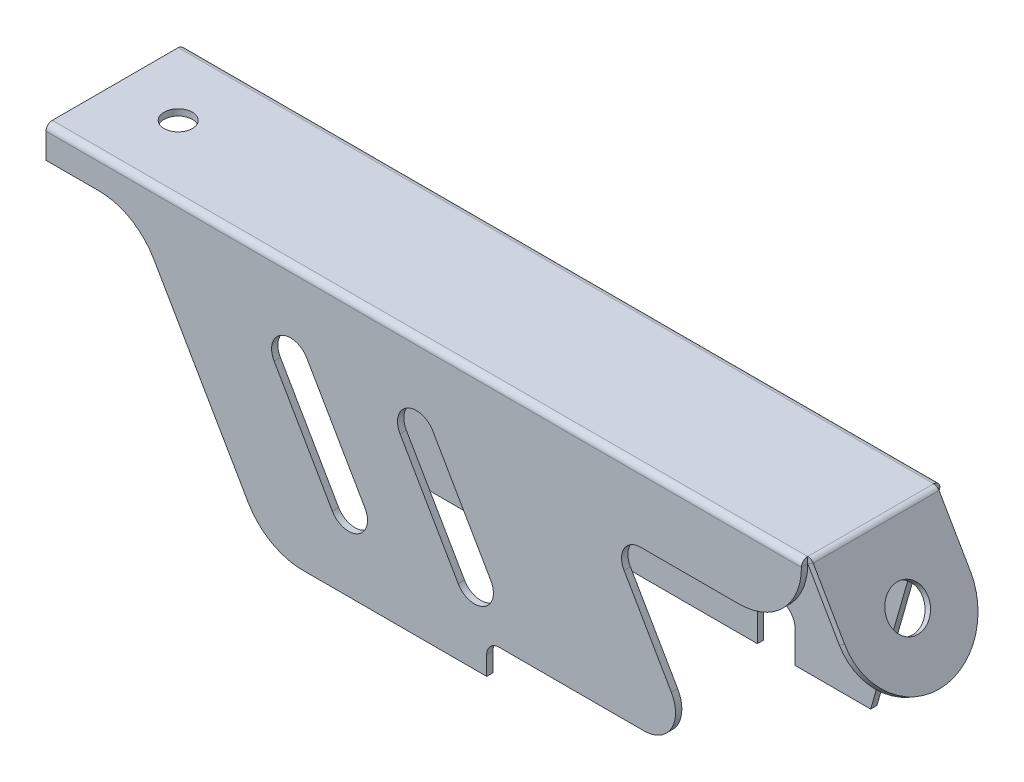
ISO-10303-21;
HEADER;
FILE_DESCRIPTION(('STEP AP214'),'2;1');
FILE_NAME('part.step','',(''),(''),'','','');
FILE_SCHEMA(('AUTOMOTIVE_DESIGN { 1 0 10303 214 1 1 1 1 }'));
ENDSEC;
DATA;
#1=APPLICATION_CONTEXT('core data for automotive mechanical design processes');
#2=APPLICATION_PROTOCOL_DEFINITION('international standard','automotive_design',2000,#1);
#3=PRODUCT_CONTEXT('',#1,'mechanical');
#4=PRODUCT('Part','Part','',(#3));
#5=PRODUCT_RELATED_PRODUCT_CATEGORY('part','',(#4));
#6=PRODUCT_DEFINITION_FORMATION('','',#4);
#7=PRODUCT_DEFINITION_CONTEXT('part definition',#1,'design');
#8=PRODUCT_DEFINITION('design','',#6,#7);
#9=PRODUCT_DEFINITION_SHAPE('','',#8);
#10=(LENGTH_UNIT() NAMED_UNIT(*) SI_UNIT(.MILLI.,.METRE.));
#11=(NAMED_UNIT(*) PLANE_ANGLE_UNIT() SI_UNIT($,.RADIAN.));
#12=(NAMED_UNIT(*) SI_UNIT($,.STERADIAN.) SOLID_ANGLE_UNIT());
#13=UNCERTAINTY_MEASURE_WITH_UNIT(LENGTH_MEASURE(1.E-05),#10,'distance_accuracy_value','');
#14=(GEOMETRIC_REPRESENTATION_CONTEXT(3) GLOBAL_UNCERTAINTY_ASSIGNED_CONTEXT((#13)) GLOBAL_UNIT_ASSIGNED_CONTEXT((#10,
#11,#12)) REPRESENTATION_CONTEXT('',''));
#15=CARTESIAN_POINT('',(0.,0.,0.));
#16=DIRECTION('',(0.,0.,1.));
#17=DIRECTION('',(1.,0.,0.));
#18=AXIS2_PLACEMENT_3D('',#15,#16,#17);
#19=CARTESIAN_POINT('',(130.,1.,0.));
#20=DIRECTION('',(0.,1.,0.));
#21=DIRECTION('',(0.,0.,1.));
#22=AXIS2_PLACEMENT_3D('',#19,#20,#21);
#23=PLANE('',#22);
#24=CARTESIAN_POINT('',(10.,1.,0.));
#25=DIRECTION('',(0.,1.,0.));
#26=DIRECTION('',(0.,0.,1.));
#27=AXIS2_PLACEMENT_3D('',#24,#25,#26);
#28=CIRCLE('',#27,2.25);
#29=CARTESIAN_POINT('',(10.,1.,2.25));
#30=VERTEX_POINT('',#29);
#31=EDGE_CURVE('E836',#30,#30,#28,.T.);
#32=ORIENTED_EDGE('',*,*,#31,.F.);
#33=EDGE_LOOP('',(#32));
#34=FACE_BOUND('',#33,.T.);
#35=DIRECTION('',(1.,0.,0.));
#36=VECTOR('',#35,1.);
#37=CARTESIAN_POINT('',(130.,1.,10.));
#38=LINE('',#37,#36);
#39=CARTESIAN_POINT('',(0.,1.,9.99999999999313));
#40=VERTEX_POINT('',#39);
#41=CARTESIAN_POINT('',(120.,1.,10.));
#42=VERTEX_POINT('',#41);
#43=EDGE_CURVE('E813',#40,#42,#38,.T.);
#44=ORIENTED_EDGE('',*,*,#43,.T.);
#45=DIRECTION('',(0.,0.,-1.));
#46=VECTOR('',#45,1.);
#47=CARTESIAN_POINT('',(120.,1.,0.));
#48=LINE('',#47,#46);
#49=CARTESIAN_POINT('',(120.,1.,-9.99999999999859));
#50=VERTEX_POINT('',#49);
#51=EDGE_CURVE('E827',#42,#50,#48,.T.);
#52=ORIENTED_EDGE('',*,*,#51,.T.);
#53=DIRECTION('',(1.,0.,0.));
#54=VECTOR('',#53,1.);
#55=CARTESIAN_POINT('',(130.,1.,-10.));
#56=LINE('',#55,#54);
#57=CARTESIAN_POINT('',(0.,1.,-10.));
#58=VERTEX_POINT('',#57);
#59=EDGE_CURVE('E656',#58,#50,#56,.T.);
#60=ORIENTED_EDGE('',*,*,#59,.F.);
#61=DIRECTION('',(0.,0.,1.));
#62=VECTOR('',#61,1.);
#63=CARTESIAN_POINT('',(0.,1.,-14.));
#64=LINE('',#63,#62);
#65=EDGE_CURVE('E833',#58,#40,#64,.T.);
#66=ORIENTED_EDGE('',*,*,#65,.T.);
#67=EDGE_LOOP('',(#44,#52,#60,#66));
#68=FACE_BOUND('',#67,.T.);
#69=ADVANCED_FACE('F63',(#34,#68),#23,.T.);
#70=CARTESIAN_POINT('',(130.,10.0005865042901,-11.001));
#71=DIRECTION('',(0.,0.,-1.));
#72=DIRECTION('',(0.,1.,0.));
#73=AXIS2_PLACEMENT_3D('',#70,#71,#72);
#74=PLANE('',#73);
#75=CARTESIAN_POINT('',(38.4529946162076,-19.9994134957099,-11.0009999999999));
#76=DIRECTION('',(0.,0.,-1.));
#77=DIRECTION('',(0.,1.,0.));
#78=AXIS2_PLACEMENT_3D('',#75,#76,#77);
#79=CIRCLE('',#78,2.25);
#80=CARTESIAN_POINT('',(38.4529946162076,-17.7494134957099,-11.0009999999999));
#81=VERTEX_POINT('',#80);
#82=EDGE_CURVE('E1012',#81,#81,#79,.T.);
#83=ORIENTED_EDGE('',*,*,#82,.F.);
#84=EDGE_LOOP('',(#83));
#85=FACE_BOUND('',#84,.T.);
#86=CARTESIAN_POINT('',(43.4529946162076,-28.6596675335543,-11.0009999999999));
#87=DIRECTION('',(0.,0.,-1.));
#88=DIRECTION('',(0.,1.,0.));
#89=AXIS2_PLACEMENT_3D('',#86,#87,#88);
#90=CIRCLE('',#89,3.);
#91=CARTESIAN_POINT('',(43.4529946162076,-25.6596675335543,-11.0009999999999));
#92=VERTEX_POINT('',#91);
#93=EDGE_CURVE('E1001',#92,#92,#90,.T.);
#94=ORIENTED_EDGE('',*,*,#93,.F.);
#95=EDGE_LOOP('',(#94));
#96=FACE_BOUND('',#95,.T.);
#97=CARTESIAN_POINT('',(106.452994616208,-19.9994134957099,-11.0009999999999));
#98=DIRECTION('',(0.,0.,-1.));
#99=DIRECTION('',(0.,1.,0.));
#100=AXIS2_PLACEMENT_3D('',#97,#98,#99);
#101=CIRCLE('',#100,2.25);
#102=CARTESIAN_POINT('',(106.452994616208,-17.7494134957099,-11.0009999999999));
#103=VERTEX_POINT('',#102);
#104=EDGE_CURVE('E1122',#103,#103,#101,.T.);
#105=ORIENTED_EDGE('',*,*,#104,.F.);
#106=EDGE_LOOP('',(#105));
#107=FACE_BOUND('',#106,.T.);
#108=DIRECTION('',(0.,1.,0.));
#109=VECTOR('',#108,1.);
#110=CARTESIAN_POINT('',(0.,-3.99941349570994,-11.001));
#111=LINE('',#110,#109);
#112=CARTESIAN_POINT('',(0.,-3.99941349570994,-11.001));
#113=VERTEX_POINT('',#112);
#114=CARTESIAN_POINT('',(0.,-0.00099999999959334,-11.001));
#115=VERTEX_POINT('',#114);
#116=EDGE_CURVE('E971',#113,#115,#111,.T.);
#117=ORIENTED_EDGE('',*,*,#116,.T.);
#118=DIRECTION('',(1.,0.,0.));
#119=VECTOR('',#118,1.);
#120=CARTESIAN_POINT('',(130.,-0.001000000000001,-11.001));
#121=LINE('',#120,#119);
#122=CARTESIAN_POINT('',(119.99954671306,-0.00100000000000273,-11.001));
#123=VERTEX_POINT('',#122);
#124=EDGE_CURVE('E976',#115,#123,#121,.T.);
#125=ORIENTED_EDGE('',*,*,#124,.T.);
#126=DIRECTION('',(-0.274721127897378,-0.961523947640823,0.));
#127=VECTOR('',#126,1.);
#128=CARTESIAN_POINT('',(120.,0.000586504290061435,-11.001));
#129=LINE('',#128,#127);
#130=CARTESIAN_POINT('',(110.,-34.9994134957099,-11.0009999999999));
#131=VERTEX_POINT('',#130);
#132=EDGE_CURVE('E986',#123,#131,#129,.T.);
#133=ORIENTED_EDGE('',*,*,#132,.T.);
#134=DIRECTION('',(-1.,0.,0.));
#135=VECTOR('',#134,1.);
#136=CARTESIAN_POINT('',(110.,-34.9994134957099,-11.0009999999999));
#137=LINE('',#136,#135);
#138=CARTESIAN_POINT('',(98.,-34.9994134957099,-11.0009999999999));
#139=VERTEX_POINT('',#138);
#140=EDGE_CURVE('E994',#131,#139,#137,.T.);
#141=ORIENTED_EDGE('',*,*,#140,.T.);
#142=DIRECTION('',(0.,1.,0.));
#143=VECTOR('',#142,1.);
#144=CARTESIAN_POINT('',(98.,-34.9994134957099,-11.0009999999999));
#145=LINE('',#144,#143);
#146=CARTESIAN_POINT('',(98.,-29.9994134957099,-11.0009999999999));
#147=VERTEX_POINT('',#146);
#148=EDGE_CURVE('E1019',#139,#147,#145,.T.);
#149=ORIENTED_EDGE('',*,*,#148,.T.);
#150=CARTESIAN_POINT('',(95.,-29.9994134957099,-11.0009999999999));
#151=DIRECTION('',(0.,0.,1.));
#152=DIRECTION('',(0.,1.,0.));
#153=AXIS2_PLACEMENT_3D('',#150,#151,#152);
#154=CIRCLE('',#153,3.);
#155=CARTESIAN_POINT('',(92.,-29.9994134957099,-11.0009999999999));
#156=VERTEX_POINT('',#155);
#157=EDGE_CURVE('E1021',#147,#156,#154,.T.);
#158=ORIENTED_EDGE('',*,*,#157,.T.);
#159=DIRECTION('',(0.,-1.,0.));
#160=VECTOR('',#159,1.);
#161=CARTESIAN_POINT('',(92.,-29.9994134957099,-11.0009999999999));
#162=LINE('',#161,#160);
#163=CARTESIAN_POINT('',(92.,-34.9994134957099,-11.0009999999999));
#164=VERTEX_POINT('',#163);
#165=EDGE_CURVE('E1023',#156,#164,#162,.T.);
#166=ORIENTED_EDGE('',*,*,#165,.T.);
#167=DIRECTION('',(-1.,0.,0.));
#168=VECTOR('',#167,1.);
#169=CARTESIAN_POINT('',(92.,-34.9994134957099,-11.0009999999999));
#170=LINE('',#169,#168);
#171=CARTESIAN_POINT('',(72.,-34.9994134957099,-11.0009999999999));
#172=VERTEX_POINT('',#171);
#173=EDGE_CURVE('E1025',#164,#172,#170,.T.);
#174=ORIENTED_EDGE('',*,*,#173,.T.);
#175=CARTESIAN_POINT('',(72.,-36.9994134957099,-11.0009999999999));
#176=DIRECTION('',(0.,0.,1.));
#177=DIRECTION('',(0.,-1.,0.));
#178=AXIS2_PLACEMENT_3D('',#175,#176,#177);
#179=CIRCLE('',#178,1.99999999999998);
#180=CARTESIAN_POINT('',(70.,-36.9994134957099,-11.0009999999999));
#181=VERTEX_POINT('',#180);
#182=EDGE_CURVE('E1027',#172,#181,#179,.T.);
#183=ORIENTED_EDGE('',*,*,#182,.T.);
#184=DIRECTION('',(0.,-1.,0.));
#185=VECTOR('',#184,1.);
#186=CARTESIAN_POINT('',(70.,-36.9994134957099,-11.0009999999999));
#187=LINE('',#186,#185);
#188=CARTESIAN_POINT('',(70.,-39.99941349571,-11.0009999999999));
#189=VERTEX_POINT('',#188);
#190=EDGE_CURVE('E1029',#181,#189,#187,.T.);
#191=ORIENTED_EDGE('',*,*,#190,.T.);
#192=DIRECTION('',(-1.,0.,0.));
#193=VECTOR('',#192,1.);
#194=CARTESIAN_POINT('',(70.,-39.99941349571,-11.0009999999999));
#195=LINE('',#194,#193);
#196=CARTESIAN_POINT('',(40.7735026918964,-39.9994134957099,-11.0009999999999));
#197=VERTEX_POINT('',#196);
#198=EDGE_CURVE('E1031',#189,#197,#195,.T.);
#199=ORIENTED_EDGE('',*,*,#198,.T.);
#200=CARTESIAN_POINT('',(40.7735026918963,-29.9994134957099,-11.0009999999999));
#201=DIRECTION('',(0.,0.,-1.));
#202=DIRECTION('',(0.,1.,0.));
#203=AXIS2_PLACEMENT_3D('',#200,#201,#202);
#204=CIRCLE('',#203,9.99999999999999);
#205=CARTESIAN_POINT('',(32.1132486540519,-34.9994134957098,-11.0009999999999));
#206=VERTEX_POINT('',#205);
#207=EDGE_CURVE('E1033',#197,#206,#204,.T.);
#208=ORIENTED_EDGE('',*,*,#207,.T.);
#209=DIRECTION('',(-0.499999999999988,0.866025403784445,0.));
#210=VECTOR('',#209,1.);
#211=CARTESIAN_POINT('',(32.1132486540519,-34.9994134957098,-11.0009999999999));
#212=LINE('',#211,#210);
#213=CARTESIAN_POINT('',(17.1021416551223,-8.9994134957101,-11.001));
#214=VERTEX_POINT('',#213);
#215=EDGE_CURVE('E1035',#206,#214,#212,.T.);
#216=ORIENTED_EDGE('',*,*,#215,.T.);
#217=CARTESIAN_POINT('',(8.44188761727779,-13.9994134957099,-11.001));
#218=DIRECTION('',(0.,0.,1.));
#219=DIRECTION('',(0.,-1.,0.));
#220=AXIS2_PLACEMENT_3D('',#217,#218,#219);
#221=CIRCLE('',#220,10.);
#222=CARTESIAN_POINT('',(8.44188761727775,-3.99941349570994,-11.001));
#223=VERTEX_POINT('',#222);
#224=EDGE_CURVE('E1037',#214,#223,#221,.T.);
#225=ORIENTED_EDGE('',*,*,#224,.T.);
#226=DIRECTION('',(-1.,0.,0.));
#227=VECTOR('',#226,1.);
#228=CARTESIAN_POINT('',(8.44188761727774,-3.99941349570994,-11.001));
#229=LINE('',#228,#227);
#230=EDGE_CURVE('E989',#223,#113,#229,.T.);
#231=ORIENTED_EDGE('',*,*,#230,.T.);
#232=EDGE_LOOP('',(#117,#125,#133,#141,#149,#158,#166,#174,#183,#191,#199,#208,#216,#225,#231));
#233=FACE_BOUND('',#232,.T.);
#234=ADVANCED_FACE('F783',(#85,#96,#107,#233),#74,.T.);
#235=CARTESIAN_POINT('',(130.,10.0005865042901,-10.001));
#236=DIRECTION('',(0.,0.,-1.));
#237=DIRECTION('',(0.,1.,0.));
#238=AXIS2_PLACEMENT_3D('',#235,#236,#237);
#239=PLANE('',#238);
#240=DIRECTION('',(1.,0.,0.));
#241=VECTOR('',#240,1.);
#242=CARTESIAN_POINT('',(130.,-0.000999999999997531,-10.001));
#243=LINE('',#242,#241);
#244=CARTESIAN_POINT('',(1.11022302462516E-13,-0.00099999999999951,-10.001));
#245=VERTEX_POINT('',#244);
#246=CARTESIAN_POINT('',(119.99954671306,-0.00099999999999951,-10.001));
#247=VERTEX_POINT('',#246);
#248=EDGE_CURVE('E870',#245,#247,#243,.T.);
#249=ORIENTED_EDGE('',*,*,#248,.F.);
#250=DIRECTION('',(0.,1.,0.));
#251=VECTOR('',#250,1.);
#252=CARTESIAN_POINT('',(0.,-3.99941349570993,-10.001));
#253=LINE('',#252,#251);
#254=CARTESIAN_POINT('',(0.,-3.99941349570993,-10.001));
#255=VERTEX_POINT('',#254);
#256=EDGE_CURVE('E973',#255,#245,#253,.T.);
#257=ORIENTED_EDGE('',*,*,#256,.F.);
#258=DIRECTION('',(-1.,0.,0.));
#259=VECTOR('',#258,1.);
#260=CARTESIAN_POINT('',(8.44188761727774,-3.99941349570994,-10.001));
#261=LINE('',#260,#259);
#262=CARTESIAN_POINT('',(8.44188761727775,-3.99941349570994,-10.001));
#263=VERTEX_POINT('',#262);
#264=EDGE_CURVE('E987',#263,#255,#261,.T.);
#265=ORIENTED_EDGE('',*,*,#264,.F.);
#266=CARTESIAN_POINT('',(8.44188761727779,-13.9994134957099,-10.001));
#267=DIRECTION('',(0.,0.,1.));
#268=DIRECTION('',(0.,-1.,0.));
#269=AXIS2_PLACEMENT_3D('',#266,#267,#268);
#270=CIRCLE('',#269,10.);
#271=CARTESIAN_POINT('',(17.1021416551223,-8.9994134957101,-10.001));
#272=VERTEX_POINT('',#271);
#273=EDGE_CURVE('E1057',#272,#263,#270,.T.);
#274=ORIENTED_EDGE('',*,*,#273,.F.);
#275=DIRECTION('',(-0.499999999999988,0.866025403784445,0.));
#276=VECTOR('',#275,1.);
#277=CARTESIAN_POINT('',(32.1132486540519,-34.9994134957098,-10.0009999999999));
#278=LINE('',#277,#276);
#279=CARTESIAN_POINT('',(32.1132486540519,-34.9994134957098,-10.0009999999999));
#280=VERTEX_POINT('',#279);
#281=EDGE_CURVE('E1055',#280,#272,#278,.T.);
#282=ORIENTED_EDGE('',*,*,#281,.F.);
#283=CARTESIAN_POINT('',(40.7735026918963,-29.9994134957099,-10.0009999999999));
#284=DIRECTION('',(0.,0.,-1.));
#285=DIRECTION('',(0.,1.,0.));
#286=AXIS2_PLACEMENT_3D('',#283,#284,#285);
#287=CIRCLE('',#286,9.99999999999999);
#288=CARTESIAN_POINT('',(40.7735026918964,-39.9994134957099,-10.0009999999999));
#289=VERTEX_POINT('',#288);
#290=EDGE_CURVE('E1053',#289,#280,#287,.T.);
#291=ORIENTED_EDGE('',*,*,#290,.F.);
#292=DIRECTION('',(-1.,0.,0.));
#293=VECTOR('',#292,1.);
#294=CARTESIAN_POINT('',(70.,-39.99941349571,-10.0009999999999));
#295=LINE('',#294,#293);
#296=CARTESIAN_POINT('',(70.,-39.99941349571,-10.0009999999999));
#297=VERTEX_POINT('',#296);
#298=EDGE_CURVE('E1051',#297,#289,#295,.T.);
#299=ORIENTED_EDGE('',*,*,#298,.F.);
#300=DIRECTION('',(0.,-1.,0.));
#301=VECTOR('',#300,1.);
#302=CARTESIAN_POINT('',(70.,-36.9994134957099,-10.0009999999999));
#303=LINE('',#302,#301);
#304=CARTESIAN_POINT('',(70.,-36.9994134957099,-10.0009999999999));
#305=VERTEX_POINT('',#304);
#306=EDGE_CURVE('E1049',#305,#297,#303,.T.);
#307=ORIENTED_EDGE('',*,*,#306,.F.);
#308=CARTESIAN_POINT('',(72.,-36.9994134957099,-10.0009999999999));
#309=DIRECTION('',(0.,0.,1.));
#310=DIRECTION('',(0.,-1.,0.));
#311=AXIS2_PLACEMENT_3D('',#308,#309,#310);
#312=CIRCLE('',#311,1.99999999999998);
#313=CARTESIAN_POINT('',(72.,-34.9994134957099,-10.0009999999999));
#314=VERTEX_POINT('',#313);
#315=EDGE_CURVE('E1047',#314,#305,#312,.T.);
#316=ORIENTED_EDGE('',*,*,#315,.F.);
#317=DIRECTION('',(-1.,0.,0.));
#318=VECTOR('',#317,1.);
#319=CARTESIAN_POINT('',(92.,-34.9994134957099,-10.0009999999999));
#320=LINE('',#319,#318);
#321=CARTESIAN_POINT('',(92.,-34.9994134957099,-10.0009999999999));
#322=VERTEX_POINT('',#321);
#323=EDGE_CURVE('E1045',#322,#314,#320,.T.);
#324=ORIENTED_EDGE('',*,*,#323,.F.);
#325=DIRECTION('',(0.,-1.,0.));
#326=VECTOR('',#325,1.);
#327=CARTESIAN_POINT('',(92.,-29.9994134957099,-10.0009999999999));
#328=LINE('',#327,#326);
#329=CARTESIAN_POINT('',(92.,-29.9994134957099,-10.0009999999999));
#330=VERTEX_POINT('',#329);
#331=EDGE_CURVE('E1043',#330,#322,#328,.T.);
#332=ORIENTED_EDGE('',*,*,#331,.F.);
#333=CARTESIAN_POINT('',(95.,-29.9994134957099,-10.0009999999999));
#334=DIRECTION('',(0.,0.,1.));
#335=DIRECTION('',(0.,1.,0.));
#336=AXIS2_PLACEMENT_3D('',#333,#334,#335);
#337=CIRCLE('',#336,3.);
#338=CARTESIAN_POINT('',(98.,-29.9994134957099,-10.0009999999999));
#339=VERTEX_POINT('',#338);
#340=EDGE_CURVE('E1041',#339,#330,#337,.T.);
#341=ORIENTED_EDGE('',*,*,#340,.F.);
#342=DIRECTION('',(0.,1.,0.));
#343=VECTOR('',#342,1.);
#344=CARTESIAN_POINT('',(98.,-34.9994134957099,-10.0009999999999));
#345=LINE('',#344,#343);
#346=CARTESIAN_POINT('',(98.,-34.9994134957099,-10.0009999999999));
#347=VERTEX_POINT('',#346);
#348=EDGE_CURVE('E1005',#347,#339,#345,.T.);
#349=ORIENTED_EDGE('',*,*,#348,.F.);
#350=DIRECTION('',(-1.,0.,0.));
#351=VECTOR('',#350,1.);
#352=CARTESIAN_POINT('',(110.,-34.9994134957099,-10.0009999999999));
#353=LINE('',#352,#351);
#354=CARTESIAN_POINT('',(110.,-34.9994134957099,-10.0009999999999));
#355=VERTEX_POINT('',#354);
#356=EDGE_CURVE('E1000',#355,#347,#353,.T.);
#357=ORIENTED_EDGE('',*,*,#356,.F.);
#358=DIRECTION('',(-0.274721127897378,-0.961523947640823,0.));
#359=VECTOR('',#358,1.);
#360=CARTESIAN_POINT('',(120.,0.000586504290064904,-10.001));
#361=LINE('',#360,#359);
#362=EDGE_CURVE('E999',#247,#355,#361,.T.);
#363=ORIENTED_EDGE('',*,*,#362,.F.);
#364=EDGE_LOOP('',(#249,#257,#265,#274,#282,#291,#299,#307,#316,#324,#332,#341,#349,#357,#363));
#365=FACE_BOUND('',#364,.T.);
#366=CARTESIAN_POINT('',(38.4529946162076,-19.9994134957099,-10.0009999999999));
#367=DIRECTION('',(0.,0.,-1.));
#368=DIRECTION('',(0.,1.,0.));
#369=AXIS2_PLACEMENT_3D('',#366,#367,#368);
#370=CIRCLE('',#369,2.25);
#371=CARTESIAN_POINT('',(38.4529946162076,-17.7494134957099,-10.0009999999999));
#372=VERTEX_POINT('',#371);
#373=EDGE_CURVE('E1015',#372,#372,#370,.T.);
#374=ORIENTED_EDGE('',*,*,#373,.T.);
#375=EDGE_LOOP('',(#374));
#376=FACE_BOUND('',#375,.T.);
#377=CARTESIAN_POINT('',(43.4529946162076,-28.6596675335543,-10.0009999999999));
#378=DIRECTION('',(0.,0.,-1.));
#379=DIRECTION('',(0.,1.,0.));
#380=AXIS2_PLACEMENT_3D('',#377,#378,#379);
#381=CIRCLE('',#380,3.);
#382=CARTESIAN_POINT('',(43.4529946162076,-25.6596675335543,-10.0009999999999));
#383=VERTEX_POINT('',#382);
#384=EDGE_CURVE('E1008',#383,#383,#381,.T.);
#385=ORIENTED_EDGE('',*,*,#384,.T.);
#386=EDGE_LOOP('',(#385));
#387=FACE_BOUND('',#386,.T.);
#388=CARTESIAN_POINT('',(106.452994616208,-19.9994134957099,-10.0009999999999));
#389=DIRECTION('',(0.,0.,-1.));
#390=DIRECTION('',(0.,1.,0.));
#391=AXIS2_PLACEMENT_3D('',#388,#389,#390);
#392=CIRCLE('',#391,2.25);
#393=CARTESIAN_POINT('',(106.452994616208,-17.7494134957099,-10.0009999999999));
#394=VERTEX_POINT('',#393);
#395=EDGE_CURVE('E866',#394,#394,#392,.T.);
#396=ORIENTED_EDGE('',*,*,#395,.T.);
#397=EDGE_LOOP('',(#396));
#398=FACE_BOUND('',#397,.T.);
#399=ADVANCED_FACE('F788',(#365,#376,#387,#398),#239,.F.);
#400=CARTESIAN_POINT('',(120.,0.000586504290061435,-11.001));
#401=DIRECTION('',(-0.961523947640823,0.274721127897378,0.));
#402=DIRECTION('',(0.274721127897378,0.961523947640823,0.));
#403=AXIS2_PLACEMENT_3D('',#400,#401,#402);
#404=PLANE('',#403);
#405=CARTESIAN_POINT('',(119.99954671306,-0.00099999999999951,-10.001));
#406=CARTESIAN_POINT('',(119.99954671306,-0.00099999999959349,-11.001));
#407=CARTESIAN_POINT('',(119.99954671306,-0.00099999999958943,-11.011));
#408=B_SPLINE_CURVE_WITH_KNOTS('',1,(#405,#406,#407),.UNSPECIFIED.,.F.,.F.,(2,1,2),(-0.01,0.99,
1.),.UNSPECIFIED.);
#409=EDGE_CURVE('E822',#247,#123,#408,.T.);
#410=ORIENTED_EDGE('',*,*,#409,.F.);
#411=ORIENTED_EDGE('',*,*,#362,.T.);
#412=DIRECTION('',(0.,0.,1.));
#413=VECTOR('',#412,1.);
#414=CARTESIAN_POINT('',(110.,-34.9994134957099,-11.0009999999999));
#415=LINE('',#414,#413);
#416=EDGE_CURVE('E980',#131,#355,#415,.T.);
#417=ORIENTED_EDGE('',*,*,#416,.F.);
#418=ORIENTED_EDGE('',*,*,#132,.F.);
#419=EDGE_LOOP('',(#410,#411,#417,#418));
#420=FACE_BOUND('',#419,.T.);
#421=ADVANCED_FACE('F799',(#420),#404,.F.);
#422=CARTESIAN_POINT('',(110.,-34.9994134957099,-11.0009999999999));
#423=DIRECTION('',(0.,1.,0.));
#424=DIRECTION('',(1.,0.,0.));
#425=AXIS2_PLACEMENT_3D('',#422,#423,#424);
#426=PLANE('',#425);
#427=ORIENTED_EDGE('',*,*,#356,.T.);
#428=DIRECTION('',(0.,0.,1.));
#429=VECTOR('',#428,1.);
#430=CARTESIAN_POINT('',(98.,-34.9994134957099,-11.0009999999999));
#431=LINE('',#430,#429);
#432=EDGE_CURVE('E1090',#139,#347,#431,.T.);
#433=ORIENTED_EDGE('',*,*,#432,.F.);
#434=ORIENTED_EDGE('',*,*,#140,.F.);
#435=ORIENTED_EDGE('',*,*,#416,.T.);
#436=EDGE_LOOP('',(#427,#433,#434,#435));
#437=FACE_BOUND('',#436,.T.);
#438=ADVANCED_FACE('F803',(#437),#426,.F.);
#439=CARTESIAN_POINT('',(98.,-34.9994134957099,-11.0009999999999));
#440=DIRECTION('',(1.,0.,0.));
#441=DIRECTION('',(0.,-1.,0.));
#442=AXIS2_PLACEMENT_3D('',#439,#440,#441);
#443=PLANE('',#442);
#444=ORIENTED_EDGE('',*,*,#348,.T.);
#445=DIRECTION('',(0.,0.,1.));
#446=VECTOR('',#445,1.);
#447=CARTESIAN_POINT('',(98.,-29.9994134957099,-11.0009999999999));
#448=LINE('',#447,#446);
#449=EDGE_CURVE('E1088',#147,#339,#448,.T.);
#450=ORIENTED_EDGE('',*,*,#449,.F.);
#451=ORIENTED_EDGE('',*,*,#148,.F.);
#452=ORIENTED_EDGE('',*,*,#432,.T.);
#453=EDGE_LOOP('',(#444,#450,#451,#452));
#454=FACE_BOUND('',#453,.T.);
#455=ADVANCED_FACE('F954',(#454),#443,.F.);
#456=CARTESIAN_POINT('',(95.,-29.9994134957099,-11.0009999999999));
#457=DIRECTION('',(0.,0.,1.));
#458=DIRECTION('',(0.,-1.,0.));
#459=AXIS2_PLACEMENT_3D('',#456,#457,#458);
#460=CYLINDRICAL_SURFACE('',#459,3.);
#461=ORIENTED_EDGE('',*,*,#340,.T.);
#462=DIRECTION('',(0.,0.,1.));
#463=VECTOR('',#462,1.);
#464=CARTESIAN_POINT('',(92.,-29.9994134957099,-11.0009999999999));
#465=LINE('',#464,#463);
#466=EDGE_CURVE('E1085',#156,#330,#465,.T.);
#467=ORIENTED_EDGE('',*,*,#466,.F.);
#468=ORIENTED_EDGE('',*,*,#157,.F.);
#469=ORIENTED_EDGE('',*,*,#449,.T.);
#470=EDGE_LOOP('',(#461,#467,#468,#469));
#471=FACE_BOUND('',#470,.T.);
#472=ADVANCED_FACE('F950',(#471),#460,.F.);
#473=CARTESIAN_POINT('',(92.,-29.9994134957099,-11.0009999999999));
#474=DIRECTION('',(-1.,0.,0.));
#475=DIRECTION('',(0.,1.,0.));
#476=AXIS2_PLACEMENT_3D('',#473,#474,#475);
#477=PLANE('',#476);
#478=ORIENTED_EDGE('',*,*,#331,.T.);
#479=DIRECTION('',(0.,0.,1.));
#480=VECTOR('',#479,1.);
#481=CARTESIAN_POINT('',(92.,-34.9994134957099,-11.0009999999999));
#482=LINE('',#481,#480);
#483=EDGE_CURVE('E1082',#164,#322,#482,.T.);
#484=ORIENTED_EDGE('',*,*,#483,.F.);
#485=ORIENTED_EDGE('',*,*,#165,.F.);
#486=ORIENTED_EDGE('',*,*,#466,.T.);
#487=EDGE_LOOP('',(#478,#484,#485,#486));
#488=FACE_BOUND('',#487,.T.);
#489=ADVANCED_FACE('F946',(#488),#477,.F.);
#490=CARTESIAN_POINT('',(92.,-34.9994134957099,-11.0009999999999));
#491=DIRECTION('',(0.,1.,0.));
#492=DIRECTION('',(1.,0.,0.));
#493=AXIS2_PLACEMENT_3D('',#490,#491,#492);
#494=PLANE('',#493);
#495=ORIENTED_EDGE('',*,*,#323,.T.);
#496=DIRECTION('',(0.,0.,1.));
#497=VECTOR('',#496,1.);
#498=CARTESIAN_POINT('',(72.,-34.9994134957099,-11.0009999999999));
#499=LINE('',#498,#497);
#500=EDGE_CURVE('E1079',#172,#314,#499,.T.);
#501=ORIENTED_EDGE('',*,*,#500,.F.);
#502=ORIENTED_EDGE('',*,*,#173,.F.);
#503=ORIENTED_EDGE('',*,*,#483,.T.);
#504=EDGE_LOOP('',(#495,#501,#502,#503));
#505=FACE_BOUND('',#504,.T.);
#506=ADVANCED_FACE('F942',(#505),#494,.F.);
#507=CARTESIAN_POINT('',(72.,-36.9994134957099,-11.0009999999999));
#508=DIRECTION('',(0.,0.,1.));
#509=DIRECTION('',(0.,-1.,0.));
#510=AXIS2_PLACEMENT_3D('',#507,#508,#509);
#511=CYLINDRICAL_SURFACE('',#510,1.99999999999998);
#512=ORIENTED_EDGE('',*,*,#315,.T.);
#513=DIRECTION('',(0.,0.,1.));
#514=VECTOR('',#513,1.);
#515=CARTESIAN_POINT('',(70.,-36.9994134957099,-11.0009999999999));
#516=LINE('',#515,#514);
#517=EDGE_CURVE('E1076',#181,#305,#516,.T.);
#518=ORIENTED_EDGE('',*,*,#517,.F.);
#519=ORIENTED_EDGE('',*,*,#182,.F.);
#520=ORIENTED_EDGE('',*,*,#500,.T.);
#521=EDGE_LOOP('',(#512,#518,#519,#520));
#522=FACE_BOUND('',#521,.T.);
#523=ADVANCED_FACE('F938',(#522),#511,.F.);
#524=CARTESIAN_POINT('',(70.,-36.9994134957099,-11.0009999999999));
#525=DIRECTION('',(-1.,0.,0.));
#526=DIRECTION('',(0.,1.,0.));
#527=AXIS2_PLACEMENT_3D('',#524,#525,#526);
#528=PLANE('',#527);
#529=ORIENTED_EDGE('',*,*,#306,.T.);
#530=DIRECTION('',(0.,0.,1.));
#531=VECTOR('',#530,1.);
#532=CARTESIAN_POINT('',(70.,-39.99941349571,-11.0009999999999));
#533=LINE('',#532,#531);
#534=EDGE_CURVE('E1073',#189,#297,#533,.T.);
#535=ORIENTED_EDGE('',*,*,#534,.F.);
#536=ORIENTED_EDGE('',*,*,#190,.F.);
#537=ORIENTED_EDGE('',*,*,#517,.T.);
#538=EDGE_LOOP('',(#529,#535,#536,#537));
#539=FACE_BOUND('',#538,.T.);
#540=ADVANCED_FACE('F934',(#539),#528,.F.);
#541=CARTESIAN_POINT('',(70.,-39.99941349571,-11.0009999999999));
#542=DIRECTION('',(0.,1.,0.));
#543=DIRECTION('',(1.,0.,0.));
#544=AXIS2_PLACEMENT_3D('',#541,#542,#543);
#545=PLANE('',#544);
#546=ORIENTED_EDGE('',*,*,#298,.T.);
#547=DIRECTION('',(0.,0.,1.));
#548=VECTOR('',#547,1.);
#549=CARTESIAN_POINT('',(40.7735026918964,-39.9994134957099,-11.0009999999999));
#550=LINE('',#549,#548);
#551=EDGE_CURVE('E1070',#197,#289,#550,.T.);
#552=ORIENTED_EDGE('',*,*,#551,.F.);
#553=ORIENTED_EDGE('',*,*,#198,.F.);
#554=ORIENTED_EDGE('',*,*,#534,.T.);
#555=EDGE_LOOP('',(#546,#552,#553,#554));
#556=FACE_BOUND('',#555,.T.);
#557=ADVANCED_FACE('F930',(#556),#545,.F.);
#558=CARTESIAN_POINT('',(40.7735026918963,-29.9994134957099,-11.0009999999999));
#559=DIRECTION('',(0.,0.,1.));
#560=DIRECTION('',(0.,-1.,0.));
#561=AXIS2_PLACEMENT_3D('',#558,#559,#560);
#562=CYLINDRICAL_SURFACE('',#561,9.99999999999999);
#563=ORIENTED_EDGE('',*,*,#290,.T.);
#564=DIRECTION('',(0.,0.,1.));
#565=VECTOR('',#564,1.);
#566=CARTESIAN_POINT('',(32.1132486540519,-34.9994134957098,-11.0009999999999));
#567=LINE('',#566,#565);
#568=EDGE_CURVE('E1067',#206,#280,#567,.T.);
#569=ORIENTED_EDGE('',*,*,#568,.F.);
#570=ORIENTED_EDGE('',*,*,#207,.F.);
#571=ORIENTED_EDGE('',*,*,#551,.T.);
#572=EDGE_LOOP('',(#563,#569,#570,#571));
#573=FACE_BOUND('',#572,.T.);
#574=ADVANCED_FACE('F926',(#573),#562,.T.);
#575=CARTESIAN_POINT('',(32.1132486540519,-34.9994134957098,-11.0009999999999));
#576=DIRECTION('',(0.866025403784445,0.499999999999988,0.));
#577=DIRECTION('',(0.499999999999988,-0.866025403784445,0.));
#578=AXIS2_PLACEMENT_3D('',#575,#576,#577);
#579=PLANE('',#578);
#580=ORIENTED_EDGE('',*,*,#281,.T.);
#581=DIRECTION('',(0.,0.,1.));
#582=VECTOR('',#581,1.);
#583=CARTESIAN_POINT('',(17.1021416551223,-8.9994134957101,-11.001));
#584=LINE('',#583,#582);
#585=EDGE_CURVE('E1064',#214,#272,#584,.T.);
#586=ORIENTED_EDGE('',*,*,#585,.F.);
#587=ORIENTED_EDGE('',*,*,#215,.F.);
#588=ORIENTED_EDGE('',*,*,#568,.T.);
#589=EDGE_LOOP('',(#580,#586,#587,#588));
#590=FACE_BOUND('',#589,.T.);
#591=ADVANCED_FACE('F922',(#590),#579,.F.);
#592=CARTESIAN_POINT('',(8.44188761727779,-13.9994134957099,-11.001));
#593=DIRECTION('',(0.,0.,1.));
#594=DIRECTION('',(0.,-1.,0.));
#595=AXIS2_PLACEMENT_3D('',#592,#593,#594);
#596=CYLINDRICAL_SURFACE('',#595,10.);
#597=ORIENTED_EDGE('',*,*,#273,.T.);
#598=DIRECTION('',(0.,0.,1.));
#599=VECTOR('',#598,1.);
#600=CARTESIAN_POINT('',(8.44188761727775,-3.99941349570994,-11.001));
#601=LINE('',#600,#599);
#602=EDGE_CURVE('E1061',#223,#263,#601,.T.);
#603=ORIENTED_EDGE('',*,*,#602,.F.);
#604=ORIENTED_EDGE('',*,*,#224,.F.);
#605=ORIENTED_EDGE('',*,*,#585,.T.);
#606=EDGE_LOOP('',(#597,#603,#604,#605));
#607=FACE_BOUND('',#606,.T.);
#608=ADVANCED_FACE('F918',(#607),#596,.F.);
#609=CARTESIAN_POINT('',(8.44188761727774,-3.99941349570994,-11.001));
#610=DIRECTION('',(0.,1.,0.));
#611=DIRECTION('',(1.,0.,0.));
#612=AXIS2_PLACEMENT_3D('',#609,#610,#611);
#613=PLANE('',#612);
#614=ORIENTED_EDGE('',*,*,#264,.T.);
#615=DIRECTION('',(0.,0.,1.));
#616=VECTOR('',#615,1.);
#617=CARTESIAN_POINT('',(0.,-3.99941349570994,-11.001));
#618=LINE('',#617,#616);
#619=EDGE_CURVE('E988',#113,#255,#618,.T.);
#620=ORIENTED_EDGE('',*,*,#619,.F.);
#621=ORIENTED_EDGE('',*,*,#230,.F.);
#622=ORIENTED_EDGE('',*,*,#602,.T.);
#623=EDGE_LOOP('',(#614,#620,#621,#622));
#624=FACE_BOUND('',#623,.T.);
#625=ADVANCED_FACE('F915',(#624),#613,.F.);
#626=CARTESIAN_POINT('',(0.,-3.99941349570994,-11.001));
#627=DIRECTION('',(1.,0.,0.));
#628=DIRECTION('',(0.,-1.,0.));
#629=AXIS2_PLACEMENT_3D('',#626,#627,#628);
#630=PLANE('',#629);
#631=DIRECTION('',(0.,0.,1.));
#632=VECTOR('',#631,1.);
#633=CARTESIAN_POINT('',(0.,-0.001000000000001,-11.001));
#634=LINE('',#633,#632);
#635=EDGE_CURVE('E968',#115,#245,#634,.T.);
#636=ORIENTED_EDGE('',*,*,#635,.F.);
#637=ORIENTED_EDGE('',*,*,#116,.F.);
#638=ORIENTED_EDGE('',*,*,#619,.T.);
#639=ORIENTED_EDGE('',*,*,#256,.T.);
#640=EDGE_LOOP('',(#636,#637,#638,#639));
#641=FACE_BOUND('',#640,.T.);
#642=ADVANCED_FACE('F913',(#641),#630,.F.);
#643=CARTESIAN_POINT('',(43.4529946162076,-28.6596675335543,-11.0009999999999));
#644=DIRECTION('',(0.,0.,1.));
#645=DIRECTION('',(0.,-1.,0.));
#646=AXIS2_PLACEMENT_3D('',#643,#644,#645);
#647=CYLINDRICAL_SURFACE('',#646,3.);
#648=ORIENTED_EDGE('',*,*,#93,.T.);
#649=EDGE_LOOP('',(#648));
#650=FACE_BOUND('',#649,.T.);
#651=ORIENTED_EDGE('',*,*,#384,.F.);
#652=EDGE_LOOP('',(#651));
#653=FACE_BOUND('',#652,.T.);
#654=ADVANCED_FACE('F909',(#650,#653),#647,.F.);
#655=CARTESIAN_POINT('',(38.4529946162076,-19.9994134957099,-11.0009999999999));
#656=DIRECTION('',(0.,0.,1.));
#657=DIRECTION('',(0.,-1.,0.));
#658=AXIS2_PLACEMENT_3D('',#655,#656,#657);
#659=CYLINDRICAL_SURFACE('',#658,2.25);
#660=ORIENTED_EDGE('',*,*,#82,.T.);
#661=EDGE_LOOP('',(#660));
#662=FACE_BOUND('',#661,.T.);
#663=ORIENTED_EDGE('',*,*,#373,.F.);
#664=EDGE_LOOP('',(#663));
#665=FACE_BOUND('',#664,.T.);
#666=ADVANCED_FACE('F905',(#662,#665),#659,.F.);
#667=CARTESIAN_POINT('',(106.452994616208,-19.9994134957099,-11.0009999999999));
#668=DIRECTION('',(0.,0.,1.));
#669=DIRECTION('',(0.,-1.,0.));
#670=AXIS2_PLACEMENT_3D('',#667,#668,#669);
#671=CYLINDRICAL_SURFACE('',#670,2.25);
#672=ORIENTED_EDGE('',*,*,#104,.T.);
#673=EDGE_LOOP('',(#672));
#674=FACE_BOUND('',#673,.T.);
#675=ORIENTED_EDGE('',*,*,#395,.F.);
#676=EDGE_LOOP('',(#675));
#677=FACE_BOUND('',#676,.T.);
#678=ADVANCED_FACE('F901',(#674,#677),#671,.F.);
#679=CARTESIAN_POINT('',(10.,1.,0.));
#680=DIRECTION('',(0.,-1.,0.));
#681=DIRECTION('',(0.,0.,-1.));
#682=AXIS2_PLACEMENT_3D('',#679,#680,#681);
#683=CYLINDRICAL_SURFACE('',#682,2.25);
#684=ORIENTED_EDGE('',*,*,#31,.T.);
#685=EDGE_LOOP('',(#684));
#686=FACE_BOUND('',#685,.T.);
#687=CARTESIAN_POINT('',(10.,0.,0.));
#688=DIRECTION('',(0.,1.,0.));
#689=DIRECTION('',(0.,0.,1.));
#690=AXIS2_PLACEMENT_3D('',#687,#688,#689);
#691=CIRCLE('',#690,2.25);
#692=CARTESIAN_POINT('',(10.,0.,2.25));
#693=VERTEX_POINT('',#692);
#694=EDGE_CURVE('E831',#693,#693,#691,.T.);
#695=ORIENTED_EDGE('',*,*,#694,.F.);
#696=EDGE_LOOP('',(#695));
#697=FACE_BOUND('',#696,.T.);
#698=ADVANCED_FACE('F797',(#686,#697),#683,.F.);
#699=CARTESIAN_POINT('',(0.,1.,-14.));
#700=DIRECTION('',(1.,0.,0.));
#701=DIRECTION('',(0.,0.,-1.));
#702=AXIS2_PLACEMENT_3D('',#699,#700,#701);
#703=PLANE('',#702);
#704=DIRECTION('',(0.,-1.,0.));
#705=VECTOR('',#704,1.);
#706=CARTESIAN_POINT('',(0.,1.,10.));
#707=LINE('',#706,#705);
#708=CARTESIAN_POINT('',(0.,0.,9.99999999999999));
#709=VERTEX_POINT('',#708);
#710=EDGE_CURVE('E821',#40,#709,#707,.T.);
#711=ORIENTED_EDGE('',*,*,#710,.F.);
#712=ORIENTED_EDGE('',*,*,#65,.F.);
#713=DIRECTION('',(0.,-1.,0.));
#714=VECTOR('',#713,1.);
#715=CARTESIAN_POINT('',(0.,1.,-10.));
#716=LINE('',#715,#714);
#717=CARTESIAN_POINT('',(0.,0.,-10.));
#718=VERTEX_POINT('',#717);
#719=EDGE_CURVE('E832',#58,#718,#716,.T.);
#720=ORIENTED_EDGE('',*,*,#719,.T.);
#721=DIRECTION('',(0.,0.,1.));
#722=VECTOR('',#721,1.);
#723=CARTESIAN_POINT('',(0.,0.,-14.));
#724=LINE('',#723,#722);
#725=EDGE_CURVE('E828',#718,#709,#724,.T.);
#726=ORIENTED_EDGE('',*,*,#725,.T.);
#727=EDGE_LOOP('',(#711,#712,#720,#726));
#728=FACE_BOUND('',#727,.T.);
#729=ADVANCED_FACE('F794',(#728),#703,.F.);
#730=CARTESIAN_POINT('',(130.,0.,0.));
#731=DIRECTION('',(0.,1.,0.));
#732=DIRECTION('',(0.,0.,1.));
#733=AXIS2_PLACEMENT_3D('',#730,#731,#732);
#734=PLANE('',#733);
#735=DIRECTION('',(0.,0.,-1.));
#736=VECTOR('',#735,1.);
#737=CARTESIAN_POINT('',(120.,0.,0.));
#738=LINE('',#737,#736);
#739=CARTESIAN_POINT('',(120.,0.,10.));
#740=VERTEX_POINT('',#739);
#741=CARTESIAN_POINT('',(120.,0.,-10.));
#742=VERTEX_POINT('',#741);
#743=EDGE_CURVE('E72',#740,#742,#738,.T.);
#744=ORIENTED_EDGE('',*,*,#743,.F.);
#745=DIRECTION('',(1.,0.,0.));
#746=VECTOR('',#745,1.);
#747=CARTESIAN_POINT('',(130.,0.,10.));
#748=LINE('',#747,#746);
#749=EDGE_CURVE('E824',#709,#740,#748,.T.);
#750=ORIENTED_EDGE('',*,*,#749,.F.);
#751=ORIENTED_EDGE('',*,*,#725,.F.);
#752=DIRECTION('',(1.,0.,0.));
#753=VECTOR('',#752,1.);
#754=CARTESIAN_POINT('',(130.,0.,-10.));
#755=LINE('',#754,#753);
#756=EDGE_CURVE('E861',#718,#742,#755,.T.);
#757=ORIENTED_EDGE('',*,*,#756,.T.);
#758=EDGE_LOOP('',(#744,#750,#751,#757));
#759=FACE_BOUND('',#758,.T.);
#760=ORIENTED_EDGE('',*,*,#694,.T.);
#761=EDGE_LOOP('',(#760));
#762=FACE_BOUND('',#761,.T.);
#763=ADVANCED_FACE('F65',(#759,#762),#734,.F.);
#764=CARTESIAN_POINT('',(0.,-0.000999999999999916,-10.));
#765=DIRECTION('',(-1.,0.,0.));
#766=DIRECTION('',(0.,0.,1.));
#767=AXIS2_PLACEMENT_3D('',#764,#765,#766);
#768=PLANE('',#767);
#769=ORIENTED_EDGE('',*,*,#635,.T.);
#770=CARTESIAN_POINT('',(1.11022302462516E-13,-0.000999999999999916,-10.));
#771=DIRECTION('',(-1.,0.,0.));
#772=DIRECTION('',(0.,0.,1.));
#773=AXIS2_PLACEMENT_3D('',#770,#771,#772);
#774=CIRCLE('',#773,0.000999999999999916);
#775=EDGE_CURVE('E599',#245,#718,#774,.F.);
#776=ORIENTED_EDGE('',*,*,#775,.T.);
#777=ORIENTED_EDGE('',*,*,#719,.F.);
#778=CARTESIAN_POINT('',(0.,-0.000999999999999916,-10.));
#779=DIRECTION('',(1.,0.,0.));
#780=DIRECTION('',(0.,0.,-1.));
#781=AXIS2_PLACEMENT_3D('',#778,#779,#780);
#782=CIRCLE('',#781,1.001);
#783=EDGE_CURVE('E657',#115,#58,#782,.T.);
#784=ORIENTED_EDGE('',*,*,#783,.F.);
#785=EDGE_LOOP('',(#769,#776,#777,#784));
#786=FACE_BOUND('',#785,.T.);
#787=ADVANCED_FACE('F635',(#786),#768,.T.);
#788=CARTESIAN_POINT('',(120.,1.01,-9.99999999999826));
#789=CARTESIAN_POINT('',(119.999962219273,1.01000000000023,-10.1323634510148));
#790=CARTESIAN_POINT('',(119.999924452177,0.983686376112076,-10.2646271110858));
#791=CARTESIAN_POINT('',(119.999848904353,0.882398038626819,-10.5091587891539));
#792=CARTESIAN_POINT('',(119.999811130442,0.807463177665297,-10.6213067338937));
#793=CARTESIAN_POINT('',(119.999735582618,0.620306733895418,-10.808463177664));
#794=CARTESIAN_POINT('',(119.999697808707,0.508158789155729,-10.8833980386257));
#795=CARTESIAN_POINT('',(119.999622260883,0.263627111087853,-10.9846863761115));
#796=CARTESIAN_POINT('',(119.999584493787,0.131363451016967,-11.0109999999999));
#797=CARTESIAN_POINT('',(119.99954671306,-0.00099999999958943,-11.011));
#798=CARTESIAN_POINT('',(120.,1.,-9.99999999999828));
#799=CARTESIAN_POINT('',(119.999962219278,1.00000000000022,-10.1310542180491));
#800=CARTESIAN_POINT('',(119.999924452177,0.973946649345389,-10.2620096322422));
#801=CARTESIAN_POINT('',(119.999848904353,0.87366017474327,-10.5041225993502));
#802=CARTESIAN_POINT('',(119.999811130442,0.799466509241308,-10.615161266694));
#803=CARTESIAN_POINT('',(119.999735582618,0.614161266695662,-10.80046650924));
#804=CARTESIAN_POINT('',(119.999697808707,0.503122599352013,-10.8746601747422));
#805=CARTESIAN_POINT('',(119.999622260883,0.261009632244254,-10.9749466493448));
#806=CARTESIAN_POINT('',(119.999584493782,0.130054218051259,-11.0009999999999));
#807=CARTESIAN_POINT('',(119.99954671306,-0.00099999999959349,-11.001));
#808=CARTESIAN_POINT('',(120.,0.,-10.));
#809=CARTESIAN_POINT('',(119.999962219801,0.,-10.0001309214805));
#810=CARTESIAN_POINT('',(119.999924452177,-2.6027323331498E-05,-10.0002617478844));
#811=CARTESIAN_POINT('',(119.999848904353,-0.000126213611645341,-10.0005036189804));
#812=CARTESIAN_POINT('',(119.999811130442,-0.000200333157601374,-10.00061454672));
#813=CARTESIAN_POINT('',(119.999735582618,-0.00038545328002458,-10.0007996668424));
#814=CARTESIAN_POINT('',(119.999697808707,-0.000496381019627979,-10.0008737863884));
#815=CARTESIAN_POINT('',(119.999622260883,-0.000738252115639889,-10.0009739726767));
#816=CARTESIAN_POINT('',(119.999584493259,-0.000869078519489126,-10.001));
#817=CARTESIAN_POINT('',(119.99954671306,-0.00099999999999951,-10.001));
#818=B_SPLINE_SURFACE_WITH_KNOTS('',1,3,((#788,#789,#790,#791,#792,#793,#794,#795,#796,#797),
(#798,#799,#800,#801,#802,#803,#804,#805,#806,#807),(#808,#809,#810,#811,#812,#813,#814,#815,
#816,#817)),.UNSPECIFIED.,.F.,.F.,.F.,(2,1,2),(4,2,2,2,4),(-0.01,0.,1.),(0.,0.25,0.5,0.75,1.),.UNSPECIFIED.);
#819=CARTESIAN_POINT('',(120.,0.,-10.));
#820=CARTESIAN_POINT('',(119.999995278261,3.470889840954E-10,-10.0000163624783));
#821=CARTESIAN_POINT('',(119.999990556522,-4.01582874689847E-07,-10.000032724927));
#822=CARTESIAN_POINT('',(119.999981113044,-2.00750471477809E-06,-10.0000654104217));
#823=CARTESIAN_POINT('',(119.999976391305,-3.21149659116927E-06,-10.0000817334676));
#824=CARTESIAN_POINT('',(119.999966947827,-6.419050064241E-06,-10.000114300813));
#825=CARTESIAN_POINT('',(119.999962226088,-8.42261166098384E-06,-10.0001305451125));
#826=CARTESIAN_POINT('',(119.99995278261,-1.32243684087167E-05,-10.0001629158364));
#827=CARTESIAN_POINT('',(119.999948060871,-1.60225635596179E-05,-10.0001790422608));
#828=CARTESIAN_POINT('',(119.999938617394,-2.24068756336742E-05,-10.0002111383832));
#829=CARTESIAN_POINT('',(119.999933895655,-2.59929925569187E-05,-10.0002271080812));
#830=CARTESIAN_POINT('',(119.999924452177,-3.3944501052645E-05,-10.0002588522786));
#831=CARTESIAN_POINT('',(119.999919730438,-3.83098926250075E-05,-10.0002746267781));
#832=CARTESIAN_POINT('',(119.99991028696,-4.78094359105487E-05,-10.0003059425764));
#833=CARTESIAN_POINT('',(119.999905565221,-5.29435876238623E-05,-10.0003214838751));
#834=CARTESIAN_POINT('',(119.999896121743,-6.39682820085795E-05,-10.0003522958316));
#835=CARTESIAN_POINT('',(119.999891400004,-6.98588246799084E-05,-10.0003675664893));
#836=CARTESIAN_POINT('',(119.999881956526,-8.23821102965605E-05,-10.0003978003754));
#837=CARTESIAN_POINT('',(119.999877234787,-8.90148532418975E-05,-10.0004127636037));
#838=CARTESIAN_POINT('',(119.999867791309,-0.000103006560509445,-10.0004423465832));
#839=CARTESIAN_POINT('',(119.99986306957,-0.000110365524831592,-10.0004569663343));
#840=CARTESIAN_POINT('',(119.999853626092,-0.000125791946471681,-10.0004858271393));
#841=CARTESIAN_POINT('',(119.999848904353,-0.000133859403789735,-10.0005000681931));
#842=CARTESIAN_POINT('',(119.999839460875,-0.000150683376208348,-10.0005281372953));
#843=CARTESIAN_POINT('',(119.999834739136,-0.000159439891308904,-10.0005419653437));
#844=CARTESIAN_POINT('',(119.999825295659,-0.000177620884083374,-10.0005691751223));
#845=CARTESIAN_POINT('',(119.99982057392,-0.000187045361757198,-10.0005825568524));
#846=CARTESIAN_POINT('',(119.999811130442,-0.000206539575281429,-10.0006088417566));
#847=CARTESIAN_POINT('',(119.999806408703,-0.000216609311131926,-10.0006217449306));
#848=CARTESIAN_POINT('',(119.999796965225,-0.000237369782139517,-10.0006470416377));
#849=CARTESIAN_POINT('',(119.999792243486,-0.000248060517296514,-10.0006594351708));
#850=CARTESIAN_POINT('',(119.999782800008,-0.000270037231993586,-10.0006836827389));
#851=CARTESIAN_POINT('',(119.999778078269,-0.000281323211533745,-10.0006955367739));
#852=CARTESIAN_POINT('',(119.999768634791,-0.000304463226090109,-10.0007186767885));
#853=CARTESIAN_POINT('',(119.999763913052,-0.000316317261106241,-10.000729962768));
#854=CARTESIAN_POINT('',(119.999754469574,-0.000340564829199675,-10.0007519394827));
#855=CARTESIAN_POINT('',(119.999749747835,-0.000352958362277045,-10.0007626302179));
#856=CARTESIAN_POINT('',(119.999740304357,-0.000378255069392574,-10.0007833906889));
#857=CARTESIAN_POINT('',(119.999735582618,-0.000391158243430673,-10.0007934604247));
#858=CARTESIAN_POINT('',(119.99972613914,-0.000417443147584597,-10.0008129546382));
#859=CARTESIAN_POINT('',(119.999721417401,-0.000430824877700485,-10.0008223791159));
#860=CARTESIAN_POINT('',(119.999711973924,-0.000458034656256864,-10.0008405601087));
#861=CARTESIAN_POINT('',(119.999707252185,-0.000471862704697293,-10.0008493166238));
#862=CARTESIAN_POINT('',(119.999697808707,-0.000499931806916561,-10.0008661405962));
#863=CARTESIAN_POINT('',(119.999693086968,-0.000514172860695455,-10.0008742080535));
#864=CARTESIAN_POINT('',(119.99968364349,-0.000543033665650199,-10.0008896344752));
#865=CARTESIAN_POINT('',(119.999678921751,-0.000557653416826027,-10.0008969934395));
#866=CARTESIAN_POINT('',(119.999669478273,-0.000587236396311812,-10.0009109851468));
#867=CARTESIAN_POINT('',(119.999664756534,-0.000602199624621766,-10.0009176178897));
#868=CARTESIAN_POINT('',(119.999655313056,-0.00063243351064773,-10.0009301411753));
#869=CARTESIAN_POINT('',(119.999650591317,-0.000647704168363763,-10.000936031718));
#870=CARTESIAN_POINT('',(119.999641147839,-0.000678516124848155,-10.0009470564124));
#871=CARTESIAN_POINT('',(119.9996364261,-0.000694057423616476,-10.0009521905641));
#872=CARTESIAN_POINT('',(119.999626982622,-0.000725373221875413,-10.0009616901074));
#873=CARTESIAN_POINT('',(119.999622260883,-0.000741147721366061,-10.0009660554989));
#874=CARTESIAN_POINT('',(119.999612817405,-0.000772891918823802,-10.0009740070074));
#875=CARTESIAN_POINT('',(119.999608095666,-0.000788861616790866,-10.0009775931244));
#876=CARTESIAN_POINT('',(119.999598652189,-0.000820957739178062,-10.0009839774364));
#877=CARTESIAN_POINT('',(119.99959393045,-0.000837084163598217,-10.0009867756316));
#878=CARTESIAN_POINT('',(119.999584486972,-0.000869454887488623,-10.0009915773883));
#879=CARTESIAN_POINT('',(119.999579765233,-0.000885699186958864,-10.0009935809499));
#880=CARTESIAN_POINT('',(119.999570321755,-0.000918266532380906,-10.0009967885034));
#881=CARTESIAN_POINT('',(119.999565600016,-0.000934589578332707,-10.0009979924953));
#882=CARTESIAN_POINT('',(119.999556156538,-0.000967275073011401,-10.0009995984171));
#883=CARTESIAN_POINT('',(119.999551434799,-0.000983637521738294,-10.0010000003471));
#884=CARTESIAN_POINT('',(119.99954671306,-0.00099999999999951,-10.001));
#885=B_SPLINE_CURVE_WITH_KNOTS('',3,(#819,#820,#821,#822,#823,#824,#825,#826,#827,#828,#829,
#830,#831,#832,#833,#834,#835,#836,#837,#838,#839,#840,#841,#842,#843,#844,#845,#846,#847,#848,
#849,#850,#851,#852,#853,#854,#855,#856,#857,#858,#859,#860,#861,#862,#863,#864,#865,#866,#867,
#868,#869,#870,#871,#872,#873,#874,#875,#876,#877,#878,#879,#880,#881,#882,#883,#884),
.UNSPECIFIED.,.F.,.F.,(4,2,2,2,2,2,2,2,2,2,2,2,2,2,2,2,2,2,2,2,2,2,2,2,2,2,2,2,2,2,2,2,4),(0.,
5.10856237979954E-05,0.000102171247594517,0.000153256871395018,0.000204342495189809,
0.000255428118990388,0.000306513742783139,0.000357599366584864,0.000408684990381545,
0.000459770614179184,0.000510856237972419,0.00056194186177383,0.000613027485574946,
0.000664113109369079,0.00071519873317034,0.000766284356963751,0.000817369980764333,
0.000868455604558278,0.000919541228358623,0.00097062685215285,0.00102171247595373,
0.00107279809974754,0.00112388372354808,0.00117496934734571,0.00122605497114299,
0.0012771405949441,0.00132822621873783,0.00137931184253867,0.00143039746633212,
0.00148148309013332,0.00153256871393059,0.0015836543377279,0.00163473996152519),.UNSPECIFIED.);
#886=EDGE_CURVE('E658',#742,#247,#885,.T.);
#887=CARTESIAN_POINT('',(120.,1.,-9.99999999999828));
#888=CARTESIAN_POINT('',(119.999995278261,1.00000034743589,-10.0163788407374));
#889=CARTESIAN_POINT('',(119.999990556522,0.999598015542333,-10.0327576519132));
#890=CARTESIAN_POINT('',(119.999981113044,0.997990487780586,-10.0654758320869));
#891=CARTESIAN_POINT('',(119.999976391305,0.996785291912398,-10.0818152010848));
#892=CARTESIAN_POINT('',(119.999966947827,0.993574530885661,-10.1144151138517));
#893=CARTESIAN_POINT('',(119.999962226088,0.991568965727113,-10.1306756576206));
#894=CARTESIAN_POINT('',(119.99995278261,0.986762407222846,-10.1630787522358));
#895=CARTESIAN_POINT('',(119.999948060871,0.983961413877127,-10.1792213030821));
#896=CARTESIAN_POINT('',(119.999938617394,0.977570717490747,-10.2113495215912));
#897=CARTESIAN_POINT('',(119.999933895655,0.973981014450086,-10.2273351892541));
#898=CARTESIAN_POINT('',(119.999924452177,0.966021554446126,-10.2591111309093));
#899=CARTESIAN_POINT('',(119.999919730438,0.961651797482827,-10.2749014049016));
#900=CARTESIAN_POINT('',(119.99991028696,0.952142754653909,-10.306248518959));
#901=CARTESIAN_POINT('',(119.999905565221,0.947003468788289,-10.3218053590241));
#902=CARTESIAN_POINT('',(119.999896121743,0.935967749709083,-10.3526481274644));
#903=CARTESIAN_POINT('',(119.999891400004,0.930071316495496,-10.3679340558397));
#904=CARTESIAN_POINT('',(119.999881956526,0.917535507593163,-10.3981981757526));
#905=CARTESIAN_POINT('',(119.999877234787,0.910896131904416,-10.4131763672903));
#906=CARTESIAN_POINT('',(119.999867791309,0.89689043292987,-10.4427889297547));
#907=CARTESIAN_POINT('',(119.99986306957,0.889524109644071,-10.4574233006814));
#908=CARTESIAN_POINT('',(119.999853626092,0.874082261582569,-10.4863129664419));
#909=CARTESIAN_POINT('',(119.999848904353,0.866006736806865,-10.5005682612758));
#910=CARTESIAN_POINT('',(119.999839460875,0.849165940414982,-10.5286654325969));
#911=CARTESIAN_POINT('',(119.999834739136,0.840400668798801,-10.5425073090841));
#912=CARTESIAN_POINT('',(119.999825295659,0.822201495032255,-10.5697442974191));
#913=CARTESIAN_POINT('',(119.99982057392,0.81276759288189,-10.5831394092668));
#914=CARTESIAN_POINT('',(119.999811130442,0.793253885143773,-10.6094505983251));
#915=CARTESIAN_POINT('',(119.999806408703,0.783174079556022,-10.6223666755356));
#916=CARTESIAN_POINT('',(119.999796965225,0.762392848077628,-10.6476886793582));
#917=CARTESIAN_POINT('',(119.999792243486,0.751691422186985,-10.6600946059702));
#918=CARTESIAN_POINT('',(119.999782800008,0.729692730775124,-10.6843664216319));
#919=CARTESIAN_POINT('',(119.999778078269,0.718395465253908,-10.6962323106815));
#920=CARTESIAN_POINT('',(119.999768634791,0.695232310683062,-10.7193954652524));
#921=CARTESIAN_POINT('',(119.999763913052,0.683366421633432,-10.7306927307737));
#922=CARTESIAN_POINT('',(119.999754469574,0.659094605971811,-10.7526914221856));
#923=CARTESIAN_POINT('',(119.999749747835,0.64668867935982,-10.7633928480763));
#924=CARTESIAN_POINT('',(119.999740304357,0.621366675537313,-10.7841740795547));
#925=CARTESIAN_POINT('',(119.999735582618,0.608450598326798,-10.7942538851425));
#926=CARTESIAN_POINT('',(119.99972613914,0.582139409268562,-10.8137675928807));
#927=CARTESIAN_POINT('',(119.999721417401,0.56874429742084,-10.823201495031));
#928=CARTESIAN_POINT('',(119.999711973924,0.541507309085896,-10.8414006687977));
#929=CARTESIAN_POINT('',(119.999707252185,0.527665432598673,-10.8501659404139));
#930=CARTESIAN_POINT('',(119.999697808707,0.499568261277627,-10.8670067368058));
#931=CARTESIAN_POINT('',(119.999693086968,0.485312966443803,-10.8750822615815));
#932=CARTESIAN_POINT('',(119.99968364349,0.456423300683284,-10.8905241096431));
#933=CARTESIAN_POINT('',(119.999678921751,0.441788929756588,-10.8978904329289));
#934=CARTESIAN_POINT('',(119.999669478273,0.412176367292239,-10.9118961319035));
#935=CARTESIAN_POINT('',(119.999664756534,0.397198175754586,-10.9185355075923));
#936=CARTESIAN_POINT('',(119.999655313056,0.366934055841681,-10.9310713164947));
#937=CARTESIAN_POINT('',(119.999650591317,0.351648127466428,-10.9369677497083));
#938=CARTESIAN_POINT('',(119.999641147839,0.320805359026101,-10.9480034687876));
#939=CARTESIAN_POINT('',(119.9996364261,0.305248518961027,-10.9531427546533));
#940=CARTESIAN_POINT('',(119.999626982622,0.273901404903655,-10.9626517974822));
#941=CARTESIAN_POINT('',(119.999622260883,0.258111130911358,-10.9670215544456));
#942=CARTESIAN_POINT('',(119.999612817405,0.226335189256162,-10.9749810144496));
#943=CARTESIAN_POINT('',(119.999608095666,0.210349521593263,-10.9785707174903));
#944=CARTESIAN_POINT('',(119.999598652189,0.178221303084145,-10.9849614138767));
#945=CARTESIAN_POINT('',(119.99959393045,0.162078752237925,-10.9877624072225));
#946=CARTESIAN_POINT('',(119.999584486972,0.129675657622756,-10.9925689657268));
#947=CARTESIAN_POINT('',(119.999579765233,0.113415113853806,-10.9945745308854));
#948=CARTESIAN_POINT('',(119.999570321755,0.0808152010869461,-10.9977852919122));
#949=CARTESIAN_POINT('',(119.999565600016,0.064475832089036,-10.9989904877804));
#950=CARTESIAN_POINT('',(119.999556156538,0.0317576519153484,-11.0005980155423));
#951=CARTESIAN_POINT('',(119.999551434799,0.015378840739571,-11.0010003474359));
#952=CARTESIAN_POINT('',(119.99954671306,-0.00099999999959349,-11.001));
#953=B_SPLINE_CURVE_WITH_KNOTS('',3,(#887,#888,#889,#890,#891,#892,#893,#894,#895,#896,#897,
#898,#899,#900,#901,#902,#903,#904,#905,#906,#907,#908,#909,#910,#911,#912,#913,#914,#915,#916,
#917,#918,#919,#920,#921,#922,#923,#924,#925,#926,#927,#928,#929,#930,#931,#932,#933,#934,#935,
#936,#937,#938,#939,#940,#941,#942,#943,#944,#945,#946,#947,#948,#949,#950,#951,#952),
.UNSPECIFIED.,.F.,.F.,(4,2,2,2,2,2,2,2,2,2,2,2,2,2,2,2,2,2,2,2,2,2,2,2,2,2,2,2,2,2,2,2,4),(0.,
0.0491315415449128,0.0982630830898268,0.147394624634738,0.196526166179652,0.245657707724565,
0.294789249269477,0.343920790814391,0.393052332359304,0.442183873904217,0.49131541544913,
0.540446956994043,0.589578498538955,0.638710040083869,0.687841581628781,0.736973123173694,
0.786104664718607,0.83523620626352,0.884367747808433,0.933499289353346,0.982630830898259,
1.03176237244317,1.08089391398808,1.130025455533,1.17915699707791,1.22828853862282,
1.27742008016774,1.32655162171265,1.37568316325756,1.42481470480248,1.47394624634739,
1.5230777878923,1.57220932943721),.UNSPECIFIED.);
#954=EDGE_CURVE('E86',#50,#123,#953,.T.);
#955=CARTESIAN_POINT('',(120.,1.01,-9.99999999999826));
#956=CARTESIAN_POINT('',(120.,1.,-9.99999999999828));
#957=CARTESIAN_POINT('',(120.,0.,-10.));
#958=B_SPLINE_CURVE_WITH_KNOTS('',1,(#955,#956,#957),.UNSPECIFIED.,.F.,.F.,(2,1,2),(-0.01,0.,
1.),.UNSPECIFIED.);
#959=EDGE_CURVE('E12',#742,#50,#958,.F.);
#960=ORIENTED_EDGE('',*,*,#886,.T.);
#961=ORIENTED_EDGE('',*,*,#409,.T.);
#962=ORIENTED_EDGE('',*,*,#954,.F.);
#963=ORIENTED_EDGE('',*,*,#959,.F.);
#964=EDGE_LOOP('',(#960,#961,#962,#963));
#965=FACE_BOUND('',#964,.T.);
#966=ADVANCED_FACE('F634',(#965),#818,.T.);
#967=CARTESIAN_POINT('',(180.004166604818,-0.000999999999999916,-10.));
#968=DIRECTION('',(-1.,0.,0.));
#969=DIRECTION('',(0.,0.,1.));
#970=AXIS2_PLACEMENT_3D('',#967,#968,#969);
#971=CYLINDRICAL_SURFACE('',#970,1.001);
#972=ORIENTED_EDGE('',*,*,#59,.T.);
#973=ORIENTED_EDGE('',*,*,#954,.T.);
#974=ORIENTED_EDGE('',*,*,#124,.F.);
#975=ORIENTED_EDGE('',*,*,#783,.T.);
#976=EDGE_LOOP('',(#972,#973,#974,#975));
#977=FACE_BOUND('',#976,.T.);
#978=ADVANCED_FACE('F630',(#977),#971,.T.);
#979=CARTESIAN_POINT('',(180.004166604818,-0.000999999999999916,-10.));
#980=DIRECTION('',(-1.,0.,0.));
#981=DIRECTION('',(0.,0.,1.));
#982=AXIS2_PLACEMENT_3D('',#979,#980,#981);
#983=CYLINDRICAL_SURFACE('',#982,0.000999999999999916);
#984=ORIENTED_EDGE('',*,*,#756,.F.);
#985=ORIENTED_EDGE('',*,*,#775,.F.);
#986=ORIENTED_EDGE('',*,*,#248,.T.);
#987=ORIENTED_EDGE('',*,*,#886,.F.);
#988=EDGE_LOOP('',(#984,#985,#986,#987));
#989=FACE_BOUND('',#988,.T.);
#990=ADVANCED_FACE('F628',(#989),#983,.F.);
#991=CARTESIAN_POINT('',(0.,-0.000999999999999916,10.));
#992=DIRECTION('',(-1.,0.,0.));
#993=DIRECTION('',(0.,0.,1.));
#994=AXIS2_PLACEMENT_3D('',#991,#992,#993);
#995=PLANE('',#994);
#996=ORIENTED_EDGE('',*,*,#710,.T.);
#997=CARTESIAN_POINT('',(0.,-0.000999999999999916,10.));
#998=DIRECTION('',(1.,0.,0.));
#999=DIRECTION('',(0.,0.,-1.));
#1000=AXIS2_PLACEMENT_3D('',#997,#998,#999);
#1001=CIRCLE('',#1000,0.000999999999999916);
#1002=CARTESIAN_POINT('',(0.,-0.000999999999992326,10.001));
#1003=VERTEX_POINT('',#1002);
#1004=EDGE_CURVE('E422',#709,#1003,#1001,.T.);
#1005=ORIENTED_EDGE('',*,*,#1004,.T.);
#1006=DIRECTION('',(0.,0.,-1.));
#1007=VECTOR('',#1006,1.);
#1008=CARTESIAN_POINT('',(0.,-0.00100000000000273,11.001));
#1009=LINE('',#1008,#1007);
#1010=CARTESIAN_POINT('',(0.,-0.000999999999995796,11.001));
#1011=VERTEX_POINT('',#1010);
#1012=EDGE_CURVE('E456',#1011,#1003,#1009,.T.);
#1013=ORIENTED_EDGE('',*,*,#1012,.F.);
#1014=CARTESIAN_POINT('',(0.,-0.000999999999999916,10.));
#1015=DIRECTION('',(1.,0.,0.));
#1016=DIRECTION('',(0.,0.,-1.));
#1017=AXIS2_PLACEMENT_3D('',#1014,#1015,#1016);
#1018=CIRCLE('',#1017,1.001);
#1019=EDGE_CURVE('E589',#40,#1011,#1018,.T.);
#1020=ORIENTED_EDGE('',*,*,#1019,.F.);
#1021=EDGE_LOOP('',(#996,#1005,#1013,#1020));
#1022=FACE_BOUND('',#1021,.T.);
#1023=ADVANCED_FACE('F624',(#1022),#995,.T.);
#1024=CARTESIAN_POINT('',(119.99999987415,-0.000999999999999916,10.));
#1025=DIRECTION('',(-1.,0.,0.));
#1026=DIRECTION('',(0.,0.,1.));
#1027=AXIS2_PLACEMENT_3D('',#1024,#1025,#1026);
#1028=PLANE('',#1027);
#1029=DIRECTION('',(0.,0.,1.));
#1030=VECTOR('',#1029,1.);
#1031=CARTESIAN_POINT('',(119.99999987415,-0.00100000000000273,11.001));
#1032=LINE('',#1031,#1030);
#1033=CARTESIAN_POINT('',(119.99999987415,-0.000999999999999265,10.001));
#1034=VERTEX_POINT('',#1033);
#1035=CARTESIAN_POINT('',(119.99999987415,-0.00099999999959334,11.001));
#1036=VERTEX_POINT('',#1035);
#1037=EDGE_CURVE('E423',#1034,#1036,#1032,.T.);
#1038=ORIENTED_EDGE('',*,*,#1037,.F.);
#1039=CARTESIAN_POINT('',(119.99999987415,-0.00099999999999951,10.001));
#1040=CARTESIAN_POINT('',(119.999999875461,-0.000983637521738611,10.0010000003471));
#1041=CARTESIAN_POINT('',(119.999999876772,-0.000967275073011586,10.0009995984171));
#1042=CARTESIAN_POINT('',(119.999999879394,-0.000934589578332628,10.0009979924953));
#1043=CARTESIAN_POINT('',(119.999999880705,-0.000918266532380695,10.0009967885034));
#1044=CARTESIAN_POINT('',(119.999999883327,-0.000885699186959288,10.0009935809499));
#1045=CARTESIAN_POINT('',(119.999999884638,-0.000869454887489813,10.0009915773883));
#1046=CARTESIAN_POINT('',(119.99999988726,-0.000837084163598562,10.0009867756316));
#1047=CARTESIAN_POINT('',(119.99999988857,-0.000820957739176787,10.0009839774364));
#1048=CARTESIAN_POINT('',(119.999999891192,-0.000788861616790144,10.0009775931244));
#1049=CARTESIAN_POINT('',(119.999999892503,-0.000772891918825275,10.0009740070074));
#1050=CARTESIAN_POINT('',(119.999999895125,-0.000741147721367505,10.0009660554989));
#1051=CARTESIAN_POINT('',(119.999999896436,-0.000725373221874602,10.0009616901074));
#1052=CARTESIAN_POINT('',(119.999999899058,-0.000694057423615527,10.0009521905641));
#1053=CARTESIAN_POINT('',(119.999999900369,-0.000678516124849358,10.0009470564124));
#1054=CARTESIAN_POINT('',(119.999999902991,-0.000647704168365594,10.000936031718));
#1055=CARTESIAN_POINT('',(119.999999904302,-0.000632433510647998,10.0009301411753));
#1056=CARTESIAN_POINT('',(119.999999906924,-0.000602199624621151,10.0009176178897));
#1057=CARTESIAN_POINT('',(119.999999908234,-0.000587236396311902,10.0009109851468));
#1058=CARTESIAN_POINT('',(119.999999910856,-0.000557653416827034,10.0008969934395));
#1059=CARTESIAN_POINT('',(119.999999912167,-0.000543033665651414,10.0008896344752));
#1060=CARTESIAN_POINT('',(119.999999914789,-0.000514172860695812,10.0008742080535));
#1061=CARTESIAN_POINT('',(119.9999999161,-0.000499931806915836,10.0008661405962));
#1062=CARTESIAN_POINT('',(119.999999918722,-0.000471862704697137,10.0008493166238));
#1063=CARTESIAN_POINT('',(119.999999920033,-0.000458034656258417,10.0008405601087));
#1064=CARTESIAN_POINT('',(119.999999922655,-0.000430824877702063,10.0008223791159));
#1065=CARTESIAN_POINT('',(119.999999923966,-0.000417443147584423,10.0008129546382));
#1066=CARTESIAN_POINT('',(119.999999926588,-0.000391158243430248,10.0007934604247));
#1067=CARTESIAN_POINT('',(119.999999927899,-0.000378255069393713,10.0007833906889));
#1068=CARTESIAN_POINT('',(119.99999993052,-0.000352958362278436,10.0007626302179));
#1069=CARTESIAN_POINT('',(119.999999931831,-0.0003405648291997,10.0007519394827));
#1070=CARTESIAN_POINT('',(119.999999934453,-0.000316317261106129,10.000729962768));
#1071=CARTESIAN_POINT('',(119.999999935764,-0.000304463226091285,10.0007186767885));
#1072=CARTESIAN_POINT('',(119.999999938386,-0.000281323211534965,10.0006955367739));
#1073=CARTESIAN_POINT('',(119.999999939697,-0.000270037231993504,10.0006836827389));
#1074=CARTESIAN_POINT('',(119.999999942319,-0.000248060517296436,10.0006594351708));
#1075=CARTESIAN_POINT('',(119.99999994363,-0.00023736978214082,10.0006470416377));
#1076=CARTESIAN_POINT('',(119.999999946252,-0.000216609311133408,10.0006217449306));
#1077=CARTESIAN_POINT('',(119.999999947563,-0.000206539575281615,10.0006088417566));
#1078=CARTESIAN_POINT('',(119.999999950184,-0.000187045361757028,10.0005825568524));
#1079=CARTESIAN_POINT('',(119.999999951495,-0.000177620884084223,10.0005691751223));
#1080=CARTESIAN_POINT('',(119.999999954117,-0.000159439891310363,10.0005419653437));
#1081=CARTESIAN_POINT('',(119.999999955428,-0.000150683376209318,10.0005281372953));
#1082=CARTESIAN_POINT('',(119.99999995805,-0.000133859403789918,10.0005000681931));
#1083=CARTESIAN_POINT('',(119.999999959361,-0.000125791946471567,10.0004858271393));
#1084=CARTESIAN_POINT('',(119.999999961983,-0.000110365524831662,10.0004569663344));
#1085=CARTESIAN_POINT('',(119.999999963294,-0.000103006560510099,10.0004423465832));
#1086=CARTESIAN_POINT('',(119.999999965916,-8.90148532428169E-05,10.0004127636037));
#1087=CARTESIAN_POINT('',(119.999999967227,-8.23821102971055E-05,10.0003978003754));
#1088=CARTESIAN_POINT('',(119.999999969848,-6.98588246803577E-05,10.0003675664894));
#1089=CARTESIAN_POINT('',(119.999999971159,-6.39682820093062E-05,10.0003522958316));
#1090=CARTESIAN_POINT('',(119.999999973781,-5.29435876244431E-05,10.0003214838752));
#1091=CARTESIAN_POINT('',(119.999999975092,-4.78094359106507E-05,10.0003059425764));
#1092=CARTESIAN_POINT('',(119.999999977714,-3.83098926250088E-05,10.0002746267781));
#1093=CARTESIAN_POINT('',(119.999999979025,-3.39445010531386E-05,10.0002588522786));
#1094=CARTESIAN_POINT('',(119.999999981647,-2.59929925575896E-05,10.0002271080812));
#1095=CARTESIAN_POINT('',(119.999999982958,-2.24068756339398E-05,10.0002111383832));
#1096=CARTESIAN_POINT('',(119.99999998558,-1.6022563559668E-05,10.0001790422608));
#1097=CARTESIAN_POINT('',(119.999999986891,-1.32243684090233E-05,10.0001629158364));
#1098=CARTESIAN_POINT('',(119.999999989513,-8.42261166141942E-06,10.0001305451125));
#1099=CARTESIAN_POINT('',(119.999999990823,-6.41905006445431E-06,10.000114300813));
#1100=CARTESIAN_POINT('',(119.999999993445,-3.21149659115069E-06,10.0000817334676));
#1101=CARTESIAN_POINT('',(119.999999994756,-2.0075047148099E-06,10.0000654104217));
#1102=CARTESIAN_POINT('',(119.999999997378,-4.01582874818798E-07,10.000032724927));
#1103=CARTESIAN_POINT('',(119.999999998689,3.47088806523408E-10,10.0000163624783));
#1104=CARTESIAN_POINT('',(120.,0.,10.));
#1105=B_SPLINE_CURVE_WITH_KNOTS('',3,(#1039,#1040,#1041,#1042,#1043,#1044,#1045,#1046,#1047,
#1048,#1049,#1050,#1051,#1052,#1053,#1054,#1055,#1056,#1057,#1058,#1059,#1060,#1061,#1062,#1063,
#1064,#1065,#1066,#1067,#1068,#1069,#1070,#1071,#1072,#1073,#1074,#1075,#1076,#1077,#1078,#1079,
#1080,#1081,#1082,#1083,#1084,#1085,#1086,#1087,#1088,#1089,#1090,#1091,#1092,#1093,#1094,#1095,
#1096,#1097,#1098,#1099,#1100,#1101,#1102,#1103,#1104),.UNSPECIFIED.,.F.,.F.,(4,2,2,2,2,2,2,2,2,
2,2,2,2,2,2,2,2,2,2,2,2,2,2,2,2,2,2,2,2,2,2,2,4),(0.,4.90824572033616E-05,9.81649144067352E-05,
0.000147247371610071,0.000196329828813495,0.000245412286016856,0.000294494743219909,
0.000343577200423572,0.000392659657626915,0.000441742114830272,0.000490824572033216,
0.00053990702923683,0.000588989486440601,0.000638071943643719,0.000687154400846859,
0.000736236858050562,0.000785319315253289,0.000834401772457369,0.000883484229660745,
0.000932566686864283,0.000981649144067,0.00103073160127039,0.0010798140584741,
0.0011288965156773,0.00117797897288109,0.00122706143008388,0.00127614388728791,
0.00132522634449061,0.00137430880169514,0.00142339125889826,0.00147247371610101,
0.00152155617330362,0.00157063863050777),.UNSPECIFIED.);
#1106=EDGE_CURVE('E593',#1034,#740,#1105,.T.);
#1107=ORIENTED_EDGE('',*,*,#1106,.T.);
#1108=DIRECTION('',(0.,-1.,0.));
#1109=VECTOR('',#1108,1.);
#1110=CARTESIAN_POINT('',(120.,1.,10.));
#1111=LINE('',#1110,#1109);
#1112=EDGE_CURVE('E839',#42,#740,#1111,.T.);
#1113=ORIENTED_EDGE('',*,*,#1112,.F.);
#1114=CARTESIAN_POINT('',(119.99999987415,-0.00099999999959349,11.001));
#1115=CARTESIAN_POINT('',(119.999999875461,0.0153788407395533,11.0010003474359));
#1116=CARTESIAN_POINT('',(119.999999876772,0.0317576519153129,11.0005980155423));
#1117=CARTESIAN_POINT('',(119.999999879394,0.0644758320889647,10.9989904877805));
#1118=CARTESIAN_POINT('',(119.999999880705,0.0808152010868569,10.9977852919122));
#1119=CARTESIAN_POINT('',(119.999999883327,0.113415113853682,10.9945745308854));
#1120=CARTESIAN_POINT('',(119.999999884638,0.129675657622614,10.9925689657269));
#1121=CARTESIAN_POINT('',(119.99999988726,0.162078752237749,10.9877624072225));
#1122=CARTESIAN_POINT('',(119.99999988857,0.178221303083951,10.9849614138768));
#1123=CARTESIAN_POINT('',(119.999999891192,0.210349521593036,10.9785707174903));
#1124=CARTESIAN_POINT('',(119.999999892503,0.226335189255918,10.9749810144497));
#1125=CARTESIAN_POINT('',(119.999999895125,0.258111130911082,10.9670215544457));
#1126=CARTESIAN_POINT('',(119.999999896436,0.273901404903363,10.9626517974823));
#1127=CARTESIAN_POINT('',(119.999999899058,0.305248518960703,10.9531427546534));
#1128=CARTESIAN_POINT('',(119.999999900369,0.320805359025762,10.9480034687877));
#1129=CARTESIAN_POINT('',(119.999999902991,0.35164812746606,10.9369677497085));
#1130=CARTESIAN_POINT('',(119.999999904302,0.366934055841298,10.9310713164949));
#1131=CARTESIAN_POINT('',(119.999999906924,0.397198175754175,10.9185355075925));
#1132=CARTESIAN_POINT('',(119.999999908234,0.412176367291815,10.9118961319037));
#1133=CARTESIAN_POINT('',(119.999999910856,0.441788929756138,10.8978904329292));
#1134=CARTESIAN_POINT('',(119.999999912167,0.456423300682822,10.8905241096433));
#1135=CARTESIAN_POINT('',(119.999999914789,0.485312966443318,10.8750822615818));
#1136=CARTESIAN_POINT('',(119.9999999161,0.499568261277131,10.8670067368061));
#1137=CARTESIAN_POINT('',(119.999999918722,0.527665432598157,10.8501659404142));
#1138=CARTESIAN_POINT('',(119.999999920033,0.54150730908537,10.841400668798));
#1139=CARTESIAN_POINT('',(119.999999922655,0.568744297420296,10.8232014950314));
#1140=CARTESIAN_POINT('',(119.999999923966,0.582139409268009,10.813767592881));
#1141=CARTESIAN_POINT('',(119.999999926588,0.60845059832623,10.7942538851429));
#1142=CARTESIAN_POINT('',(119.999999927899,0.621366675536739,10.7841740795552));
#1143=CARTESIAN_POINT('',(119.99999993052,0.646688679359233,10.7633928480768));
#1144=CARTESIAN_POINT('',(119.999999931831,0.659094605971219,10.7526914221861));
#1145=CARTESIAN_POINT('',(119.999999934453,0.683366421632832,10.7306927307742));
#1146=CARTESIAN_POINT('',(119.999999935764,0.695232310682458,10.719395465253));
#1147=CARTESIAN_POINT('',(119.999999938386,0.718395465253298,10.6962323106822));
#1148=CARTESIAN_POINT('',(119.999999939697,0.729692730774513,10.6843664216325));
#1149=CARTESIAN_POINT('',(119.999999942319,0.751691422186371,10.6600946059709));
#1150=CARTESIAN_POINT('',(119.99999994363,0.762392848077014,10.6476886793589));
#1151=CARTESIAN_POINT('',(119.999999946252,0.78317407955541,10.6223666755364));
#1152=CARTESIAN_POINT('',(119.999999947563,0.793253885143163,10.6094505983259));
#1153=CARTESIAN_POINT('',(119.999999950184,0.812767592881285,10.5831394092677));
#1154=CARTESIAN_POINT('',(119.999999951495,0.822201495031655,10.56974429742));
#1155=CARTESIAN_POINT('',(119.999999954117,0.84040066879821,10.542507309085));
#1156=CARTESIAN_POINT('',(119.999999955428,0.849165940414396,10.5286654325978));
#1157=CARTESIAN_POINT('',(119.99999995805,0.866006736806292,10.5005682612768));
#1158=CARTESIAN_POINT('',(119.999999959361,0.874082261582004,10.486312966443));
#1159=CARTESIAN_POINT('',(119.999999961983,0.889524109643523,10.4574233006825));
#1160=CARTESIAN_POINT('',(119.999999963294,0.896890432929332,10.4427889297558));
#1161=CARTESIAN_POINT('',(119.999999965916,0.910896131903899,10.4131763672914));
#1162=CARTESIAN_POINT('',(119.999999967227,0.917535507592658,10.3981981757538));
#1163=CARTESIAN_POINT('',(119.999999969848,0.930071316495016,10.3679340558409));
#1164=CARTESIAN_POINT('',(119.999999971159,0.935967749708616,10.3526481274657));
#1165=CARTESIAN_POINT('',(119.999999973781,0.947003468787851,10.3218053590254));
#1166=CARTESIAN_POINT('',(119.999999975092,0.952142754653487,10.3062485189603));
#1167=CARTESIAN_POINT('',(119.999999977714,0.961651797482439,10.274901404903));
#1168=CARTESIAN_POINT('',(119.999999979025,0.966021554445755,10.2591111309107));
#1169=CARTESIAN_POINT('',(119.999999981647,0.973981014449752,10.2273351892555));
#1170=CARTESIAN_POINT('',(119.999999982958,0.977570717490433,10.2113495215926));
#1171=CARTESIAN_POINT('',(119.99999998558,0.983961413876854,10.1792213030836));
#1172=CARTESIAN_POINT('',(119.999999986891,0.986762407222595,10.1630787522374));
#1173=CARTESIAN_POINT('',(119.999999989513,0.991568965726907,10.1306756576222));
#1174=CARTESIAN_POINT('',(119.999999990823,0.993574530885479,10.1144151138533));
#1175=CARTESIAN_POINT('',(119.999999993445,0.996785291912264,10.0818152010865));
#1176=CARTESIAN_POINT('',(119.999999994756,0.997990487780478,10.0654758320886));
#1177=CARTESIAN_POINT('',(119.999999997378,0.999598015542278,10.0327576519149));
#1178=CARTESIAN_POINT('',(119.999999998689,1.00000034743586,10.0163788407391));
#1179=CARTESIAN_POINT('',(120.,1.,10.));
#1180=B_SPLINE_CURVE_WITH_KNOTS('',3,(#1114,#1115,#1116,#1117,#1118,#1119,#1120,#1121,#1122,
#1123,#1124,#1125,#1126,#1127,#1128,#1129,#1130,#1131,#1132,#1133,#1134,#1135,#1136,#1137,#1138,
#1139,#1140,#1141,#1142,#1143,#1144,#1145,#1146,#1147,#1148,#1149,#1150,#1151,#1152,#1153,#1154,
#1155,#1156,#1157,#1158,#1159,#1160,#1161,#1162,#1163,#1164,#1165,#1166,#1167,#1168,#1169,#1170,
#1171,#1172,#1173,#1174,#1175,#1176,#1177,#1178,#1179),.UNSPECIFIED.,.F.,.F.,(4,2,2,2,2,2,2,2,2,
2,2,2,2,2,2,2,2,2,2,2,2,2,2,2,2,2,2,2,2,2,2,2,4),(0.,0.0491315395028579,0.0982630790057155,
0.147394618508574,0.196526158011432,0.245657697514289,0.294789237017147,0.343920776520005,
0.393052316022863,0.442183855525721,0.491315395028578,0.540446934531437,0.589578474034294,
0.638710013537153,0.68784155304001,0.736973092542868,0.786104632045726,0.835236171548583,
0.884367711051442,0.933499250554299,0.982630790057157,1.03176232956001,1.08089386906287,
1.13002540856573,1.17915694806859,1.22828848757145,1.2774200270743,1.32655156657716,
1.37568310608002,1.42481464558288,1.47394618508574,1.52307772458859,1.57220926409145),.UNSPECIFIED.);
#1181=EDGE_CURVE('E592',#1036,#42,#1180,.T.);
#1182=ORIENTED_EDGE('',*,*,#1181,.F.);
#1183=EDGE_LOOP('',(#1038,#1107,#1113,#1182));
#1184=FACE_BOUND('',#1183,.T.);
#1185=ADVANCED_FACE('F613',(#1184),#1028,.F.);
#1186=CARTESIAN_POINT('',(-60.0041666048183,-0.000999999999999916,10.));
#1187=DIRECTION('',(1.,0.,0.));
#1188=DIRECTION('',(0.,0.,-1.));
#1189=AXIS2_PLACEMENT_3D('',#1186,#1187,#1188);
#1190=CYLINDRICAL_SURFACE('',#1189,1.001);
#1191=ORIENTED_EDGE('',*,*,#1181,.T.);
#1192=ORIENTED_EDGE('',*,*,#43,.F.);
#1193=ORIENTED_EDGE('',*,*,#1019,.T.);
#1194=DIRECTION('',(1.,0.,0.));
#1195=VECTOR('',#1194,1.);
#1196=CARTESIAN_POINT('',(130.,-0.00100000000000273,11.001));
#1197=LINE('',#1196,#1195);
#1198=EDGE_CURVE('E586',#1011,#1036,#1197,.T.);
#1199=ORIENTED_EDGE('',*,*,#1198,.T.);
#1200=EDGE_LOOP('',(#1191,#1192,#1193,#1199));
#1201=FACE_BOUND('',#1200,.T.);
#1202=ADVANCED_FACE('F603',(#1201),#1190,.T.);
#1203=CARTESIAN_POINT('',(-60.0041666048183,-0.000999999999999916,10.));
#1204=DIRECTION('',(1.,0.,0.));
#1205=DIRECTION('',(0.,0.,-1.));
#1206=AXIS2_PLACEMENT_3D('',#1203,#1204,#1205);
#1207=CYLINDRICAL_SURFACE('',#1206,0.000999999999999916);
#1208=ORIENTED_EDGE('',*,*,#1106,.F.);
#1209=DIRECTION('',(1.,0.,0.));
#1210=VECTOR('',#1209,1.);
#1211=CARTESIAN_POINT('',(130.,-0.000999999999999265,10.001));
#1212=LINE('',#1211,#1210);
#1213=EDGE_CURVE('E427',#1003,#1034,#1212,.T.);
#1214=ORIENTED_EDGE('',*,*,#1213,.F.);
#1215=ORIENTED_EDGE('',*,*,#1004,.F.);
#1216=ORIENTED_EDGE('',*,*,#749,.T.);
#1217=EDGE_LOOP('',(#1208,#1214,#1215,#1216));
#1218=FACE_BOUND('',#1217,.T.);
#1219=ADVANCED_FACE('F612',(#1218),#1207,.F.);
#1220=CARTESIAN_POINT('',(38.8341924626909,-11.9994134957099,11.001));
#1221=DIRECTION('',(0.,0.,-1.));
#1222=DIRECTION('',(0.,1.,0.));
#1223=AXIS2_PLACEMENT_3D('',#1220,#1221,#1222);
#1224=CYLINDRICAL_SURFACE('',#1223,3.);
#1225=CARTESIAN_POINT('',(38.8341924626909,-11.9994134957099,10.001));
#1226=DIRECTION('',(0.,0.,1.));
#1227=DIRECTION('',(0.,-1.,0.));
#1228=AXIS2_PLACEMENT_3D('',#1225,#1226,#1227);
#1229=CIRCLE('',#1228,3.);
#1230=CARTESIAN_POINT('',(41.4322686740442,-10.49941349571,10.001));
#1231=VERTEX_POINT('',#1230);
#1232=CARTESIAN_POINT('',(36.2361162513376,-13.4994134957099,10.001));
#1233=VERTEX_POINT('',#1232);
#1234=EDGE_CURVE('E445',#1231,#1233,#1229,.T.);
#1235=ORIENTED_EDGE('',*,*,#1234,.F.);
#1236=DIRECTION('',(0.,0.,-1.));
#1237=VECTOR('',#1236,1.);
#1238=CARTESIAN_POINT('',(41.4322686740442,-10.49941349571,11.001));
#1239=LINE('',#1238,#1237);
#1240=CARTESIAN_POINT('',(41.4322686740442,-10.49941349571,11.001));
#1241=VERTEX_POINT('',#1240);
#1242=EDGE_CURVE('E567',#1241,#1231,#1239,.T.);
#1243=ORIENTED_EDGE('',*,*,#1242,.F.);
#1244=CARTESIAN_POINT('',(38.8341924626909,-11.9994134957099,11.001));
#1245=DIRECTION('',(0.,0.,1.));
#1246=DIRECTION('',(0.,-1.,0.));
#1247=AXIS2_PLACEMENT_3D('',#1244,#1245,#1246);
#1248=CIRCLE('',#1247,3.);
#1249=CARTESIAN_POINT('',(36.2361162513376,-13.4994134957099,11.001));
#1250=VERTEX_POINT('',#1249);
#1251=EDGE_CURVE('E583',#1241,#1250,#1248,.T.);
#1252=ORIENTED_EDGE('',*,*,#1251,.T.);
#1253=DIRECTION('',(0.,0.,-1.));
#1254=VECTOR('',#1253,1.);
#1255=CARTESIAN_POINT('',(36.2361162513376,-13.4994134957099,11.001));
#1256=LINE('',#1255,#1254);
#1257=EDGE_CURVE('E581',#1250,#1233,#1256,.T.);
#1258=ORIENTED_EDGE('',*,*,#1257,.T.);
#1259=EDGE_LOOP('',(#1235,#1243,#1252,#1258));
#1260=FACE_BOUND('',#1259,.T.);
#1261=ADVANCED_FACE('F620',(#1260),#1224,.F.);
#1262=CARTESIAN_POINT('',(45.4737205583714,-29.4994134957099,11.0009999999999));
#1263=DIRECTION('',(0.866025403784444,0.49999999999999,0.));
#1264=DIRECTION('',(-0.49999999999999,0.866025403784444,0.));
#1265=AXIS2_PLACEMENT_3D('',#1262,#1263,#1264);
#1266=PLANE('',#1265);
#1267=DIRECTION('',(0.49999999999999,-0.866025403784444,0.));
#1268=VECTOR('',#1267,1.);
#1269=CARTESIAN_POINT('',(45.4737205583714,-29.4994134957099,10.0009999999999));
#1270=LINE('',#1269,#1268);
#1271=CARTESIAN_POINT('',(45.4737205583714,-29.4994134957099,10.0009999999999));
#1272=VERTEX_POINT('',#1271);
#1273=EDGE_CURVE('E442',#1233,#1272,#1270,.T.);
#1274=ORIENTED_EDGE('',*,*,#1273,.F.);
#1275=ORIENTED_EDGE('',*,*,#1257,.F.);
#1276=DIRECTION('',(0.49999999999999,-0.866025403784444,0.));
#1277=VECTOR('',#1276,1.);
#1278=CARTESIAN_POINT('',(45.4737205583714,-29.4994134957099,11.0009999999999));
#1279=LINE('',#1278,#1277);
#1280=CARTESIAN_POINT('',(45.4737205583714,-29.4994134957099,11.0009999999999));
#1281=VERTEX_POINT('',#1280);
#1282=EDGE_CURVE('E579',#1250,#1281,#1279,.T.);
#1283=ORIENTED_EDGE('',*,*,#1282,.T.);
#1284=DIRECTION('',(0.,0.,-1.));
#1285=VECTOR('',#1284,1.);
#1286=CARTESIAN_POINT('',(45.4737205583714,-29.4994134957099,11.0009999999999));
#1287=LINE('',#1286,#1285);
#1288=EDGE_CURVE('E576',#1281,#1272,#1287,.T.);
#1289=ORIENTED_EDGE('',*,*,#1288,.T.);
#1290=EDGE_LOOP('',(#1274,#1275,#1283,#1289));
#1291=FACE_BOUND('',#1290,.T.);
#1292=ADVANCED_FACE('F690',(#1291),#1266,.T.);
#1293=CARTESIAN_POINT('',(48.0717967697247,-27.9994134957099,11.0009999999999));
#1294=DIRECTION('',(0.,0.,-1.));
#1295=DIRECTION('',(0.,1.,0.));
#1296=AXIS2_PLACEMENT_3D('',#1293,#1294,#1295);
#1297=CYLINDRICAL_SURFACE('',#1296,3.);
#1298=CARTESIAN_POINT('',(48.0717967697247,-27.9994134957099,10.0009999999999));
#1299=DIRECTION('',(0.,0.,1.));
#1300=DIRECTION('',(0.,-1.,0.));
#1301=AXIS2_PLACEMENT_3D('',#1298,#1299,#1300);
#1302=CIRCLE('',#1301,3.);
#1303=CARTESIAN_POINT('',(50.669872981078,-26.49941349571,10.0009999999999));
#1304=VERTEX_POINT('',#1303);
#1305=EDGE_CURVE('E451',#1272,#1304,#1302,.T.);
#1306=ORIENTED_EDGE('',*,*,#1305,.F.);
#1307=ORIENTED_EDGE('',*,*,#1288,.F.);
#1308=CARTESIAN_POINT('',(48.0717967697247,-27.9994134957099,11.0009999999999));
#1309=DIRECTION('',(0.,0.,1.));
#1310=DIRECTION('',(0.,-1.,0.));
#1311=AXIS2_PLACEMENT_3D('',#1308,#1309,#1310);
#1312=CIRCLE('',#1311,3.);
#1313=CARTESIAN_POINT('',(50.669872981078,-26.49941349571,11.0009999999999));
#1314=VERTEX_POINT('',#1313);
#1315=EDGE_CURVE('E574',#1281,#1314,#1312,.T.);
#1316=ORIENTED_EDGE('',*,*,#1315,.T.);
#1317=DIRECTION('',(0.,0.,-1.));
#1318=VECTOR('',#1317,1.);
#1319=CARTESIAN_POINT('',(50.669872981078,-26.49941349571,11.0009999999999));
#1320=LINE('',#1319,#1318);
#1321=EDGE_CURVE('E571',#1314,#1304,#1320,.T.);
#1322=ORIENTED_EDGE('',*,*,#1321,.T.);
#1323=EDGE_LOOP('',(#1306,#1307,#1316,#1322));
#1324=FACE_BOUND('',#1323,.T.);
#1325=ADVANCED_FACE('F694',(#1324),#1297,.F.);
#1326=CARTESIAN_POINT('',(50.669872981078,-26.49941349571,11.0009999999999));
#1327=DIRECTION('',(-0.866025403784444,-0.49999999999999,0.));
#1328=DIRECTION('',(0.49999999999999,-0.866025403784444,0.));
#1329=AXIS2_PLACEMENT_3D('',#1326,#1327,#1328);
#1330=PLANE('',#1329);
#1331=DIRECTION('',(-0.49999999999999,0.866025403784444,0.));
#1332=VECTOR('',#1331,1.);
#1333=CARTESIAN_POINT('',(50.669872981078,-26.49941349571,10.0009999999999));
#1334=LINE('',#1333,#1332);
#1335=EDGE_CURVE('E448',#1304,#1231,#1334,.T.);
#1336=ORIENTED_EDGE('',*,*,#1335,.F.);
#1337=ORIENTED_EDGE('',*,*,#1321,.F.);
#1338=DIRECTION('',(-0.49999999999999,0.866025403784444,0.));
#1339=VECTOR('',#1338,1.);
#1340=CARTESIAN_POINT('',(50.669872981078,-26.49941349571,11.0009999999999));
#1341=LINE('',#1340,#1339);
#1342=EDGE_CURVE('E569',#1314,#1241,#1341,.T.);
#1343=ORIENTED_EDGE('',*,*,#1342,.T.);
#1344=ORIENTED_EDGE('',*,*,#1242,.T.);
#1345=EDGE_LOOP('',(#1336,#1337,#1343,#1344));
#1346=FACE_BOUND('',#1345,.T.);
#1347=ADVANCED_FACE('F698',(#1346),#1330,.T.);
#1348=CARTESIAN_POINT('',(68.0717967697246,-27.9994134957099,11.0009999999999));
#1349=DIRECTION('',(0.,0.,-1.));
#1350=DIRECTION('',(0.,1.,0.));
#1351=AXIS2_PLACEMENT_3D('',#1348,#1349,#1350);
#1352=CYLINDRICAL_SURFACE('',#1351,3.);
#1353=CARTESIAN_POINT('',(68.0717967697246,-27.9994134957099,10.0009999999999));
#1354=DIRECTION('',(0.,0.,1.));
#1355=DIRECTION('',(0.,-1.,0.));
#1356=AXIS2_PLACEMENT_3D('',#1353,#1354,#1355);
#1357=CIRCLE('',#1356,3.);
#1358=CARTESIAN_POINT('',(65.4737205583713,-29.4994134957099,10.0009999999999));
#1359=VERTEX_POINT('',#1358);
#1360=CARTESIAN_POINT('',(70.6698729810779,-26.4994134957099,10.0009999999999));
#1361=VERTEX_POINT('',#1360);
#1362=EDGE_CURVE('E433',#1359,#1361,#1357,.T.);
#1363=ORIENTED_EDGE('',*,*,#1362,.F.);
#1364=DIRECTION('',(0.,0.,-1.));
#1365=VECTOR('',#1364,1.);
#1366=CARTESIAN_POINT('',(65.4737205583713,-29.4994134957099,11.0009999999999));
#1367=LINE('',#1366,#1365);
#1368=CARTESIAN_POINT('',(65.4737205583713,-29.4994134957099,11.0009999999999));
#1369=VERTEX_POINT('',#1368);
#1370=EDGE_CURVE('E548',#1369,#1359,#1367,.T.);
#1371=ORIENTED_EDGE('',*,*,#1370,.F.);
#1372=CARTESIAN_POINT('',(68.0717967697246,-27.9994134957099,11.0009999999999));
#1373=DIRECTION('',(0.,0.,1.));
#1374=DIRECTION('',(0.,-1.,0.));
#1375=AXIS2_PLACEMENT_3D('',#1372,#1373,#1374);
#1376=CIRCLE('',#1375,3.);
#1377=CARTESIAN_POINT('',(70.6698729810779,-26.4994134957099,11.0009999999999));
#1378=VERTEX_POINT('',#1377);
#1379=EDGE_CURVE('E564',#1369,#1378,#1376,.T.);
#1380=ORIENTED_EDGE('',*,*,#1379,.T.);
#1381=DIRECTION('',(0.,0.,-1.));
#1382=VECTOR('',#1381,1.);
#1383=CARTESIAN_POINT('',(70.6698729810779,-26.4994134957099,11.0009999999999));
#1384=LINE('',#1383,#1382);
#1385=EDGE_CURVE('E562',#1378,#1361,#1384,.T.);
#1386=ORIENTED_EDGE('',*,*,#1385,.T.);
#1387=EDGE_LOOP('',(#1363,#1371,#1380,#1386));
#1388=FACE_BOUND('',#1387,.T.);
#1389=ADVANCED_FACE('F702',(#1388),#1352,.F.);
#1390=CARTESIAN_POINT('',(70.6698729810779,-26.4994134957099,11.0009999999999));
#1391=DIRECTION('',(-0.86602540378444,-0.499999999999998,0.));
#1392=DIRECTION('',(0.499999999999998,-0.86602540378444,0.));
#1393=AXIS2_PLACEMENT_3D('',#1390,#1391,#1392);
#1394=PLANE('',#1393);
#1395=DIRECTION('',(-0.499999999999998,0.866025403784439,0.));
#1396=VECTOR('',#1395,1.);
#1397=CARTESIAN_POINT('',(70.6698729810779,-26.4994134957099,10.0009999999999));
#1398=LINE('',#1397,#1396);
#1399=CARTESIAN_POINT('',(61.432268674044,-10.4994134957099,10.001));
#1400=VERTEX_POINT('',#1399);
#1401=EDGE_CURVE('E430',#1361,#1400,#1398,.T.);
#1402=ORIENTED_EDGE('',*,*,#1401,.F.);
#1403=ORIENTED_EDGE('',*,*,#1385,.F.);
#1404=DIRECTION('',(-0.499999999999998,0.866025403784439,0.));
#1405=VECTOR('',#1404,1.);
#1406=CARTESIAN_POINT('',(70.6698729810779,-26.4994134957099,11.0009999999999));
#1407=LINE('',#1406,#1405);
#1408=CARTESIAN_POINT('',(61.4322686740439,-10.4994134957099,11.001));
#1409=VERTEX_POINT('',#1408);
#1410=EDGE_CURVE('E560',#1378,#1409,#1407,.T.);
#1411=ORIENTED_EDGE('',*,*,#1410,.T.);
#1412=DIRECTION('',(0.,0.,-1.));
#1413=VECTOR('',#1412,1.);
#1414=CARTESIAN_POINT('',(61.4322686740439,-10.4994134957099,11.001));
#1415=LINE('',#1414,#1413);
#1416=EDGE_CURVE('E557',#1409,#1400,#1415,.T.);
#1417=ORIENTED_EDGE('',*,*,#1416,.T.);
#1418=EDGE_LOOP('',(#1402,#1403,#1411,#1417));
#1419=FACE_BOUND('',#1418,.T.);
#1420=ADVANCED_FACE('F706',(#1419),#1394,.T.);
#1421=CARTESIAN_POINT('',(58.8341924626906,-11.9994134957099,11.001));
#1422=DIRECTION('',(0.,0.,-1.));
#1423=DIRECTION('',(0.,1.,0.));
#1424=AXIS2_PLACEMENT_3D('',#1421,#1422,#1423);
#1425=CYLINDRICAL_SURFACE('',#1424,2.99999999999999);
#1426=CARTESIAN_POINT('',(58.8341924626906,-11.9994134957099,10.001));
#1427=DIRECTION('',(0.,0.,1.));
#1428=DIRECTION('',(0.,-1.,0.));
#1429=AXIS2_PLACEMENT_3D('',#1426,#1427,#1428);
#1430=CIRCLE('',#1429,2.99999999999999);
#1431=CARTESIAN_POINT('',(56.2361162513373,-13.4994134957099,10.001));
#1432=VERTEX_POINT('',#1431);
#1433=EDGE_CURVE('E439',#1400,#1432,#1430,.T.);
#1434=ORIENTED_EDGE('',*,*,#1433,.F.);
#1435=ORIENTED_EDGE('',*,*,#1416,.F.);
#1436=CARTESIAN_POINT('',(58.8341924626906,-11.9994134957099,11.001));
#1437=DIRECTION('',(0.,0.,1.));
#1438=DIRECTION('',(0.,-1.,0.));
#1439=AXIS2_PLACEMENT_3D('',#1436,#1437,#1438);
#1440=CIRCLE('',#1439,2.99999999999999);
#1441=CARTESIAN_POINT('',(56.2361162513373,-13.4994134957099,11.001));
#1442=VERTEX_POINT('',#1441);
#1443=EDGE_CURVE('E555',#1409,#1442,#1440,.T.);
#1444=ORIENTED_EDGE('',*,*,#1443,.T.);
#1445=DIRECTION('',(0.,0.,-1.));
#1446=VECTOR('',#1445,1.);
#1447=CARTESIAN_POINT('',(56.2361162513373,-13.4994134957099,11.001));
#1448=LINE('',#1447,#1446);
#1449=EDGE_CURVE('E552',#1442,#1432,#1448,.T.);
#1450=ORIENTED_EDGE('',*,*,#1449,.T.);
#1451=EDGE_LOOP('',(#1434,#1435,#1444,#1450));
#1452=FACE_BOUND('',#1451,.T.);
#1453=ADVANCED_FACE('F710',(#1452),#1425,.F.);
#1454=CARTESIAN_POINT('',(65.4737205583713,-29.4994134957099,11.0009999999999));
#1455=DIRECTION('',(0.86602540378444,0.499999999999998,0.));
#1456=DIRECTION('',(-0.499999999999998,0.86602540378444,0.));
#1457=AXIS2_PLACEMENT_3D('',#1454,#1455,#1456);
#1458=PLANE('',#1457);
#1459=DIRECTION('',(0.499999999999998,-0.86602540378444,0.));
#1460=VECTOR('',#1459,1.);
#1461=CARTESIAN_POINT('',(65.4737205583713,-29.4994134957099,10.0009999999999));
#1462=LINE('',#1461,#1460);
#1463=EDGE_CURVE('E436',#1432,#1359,#1462,.T.);
#1464=ORIENTED_EDGE('',*,*,#1463,.F.);
#1465=ORIENTED_EDGE('',*,*,#1449,.F.);
#1466=DIRECTION('',(0.499999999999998,-0.86602540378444,0.));
#1467=VECTOR('',#1466,1.);
#1468=CARTESIAN_POINT('',(65.4737205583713,-29.4994134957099,11.0009999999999));
#1469=LINE('',#1468,#1467);
#1470=EDGE_CURVE('E550',#1442,#1369,#1469,.T.);
#1471=ORIENTED_EDGE('',*,*,#1470,.T.);
#1472=ORIENTED_EDGE('',*,*,#1370,.T.);
#1473=EDGE_LOOP('',(#1464,#1465,#1471,#1472));
#1474=FACE_BOUND('',#1473,.T.);
#1475=ADVANCED_FACE('F714',(#1474),#1458,.T.);
#1476=CARTESIAN_POINT('',(94.4226497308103,-9.99941349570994,11.001));
#1477=DIRECTION('',(0.,1.,0.));
#1478=DIRECTION('',(-1.,0.,0.));
#1479=AXIS2_PLACEMENT_3D('',#1476,#1477,#1478);
#1480=PLANE('',#1479);
#1481=DIRECTION('',(1.,0.,0.));
#1482=VECTOR('',#1481,1.);
#1483=CARTESIAN_POINT('',(94.4226497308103,-9.99941349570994,10.001));
#1484=LINE('',#1483,#1482);
#1485=CARTESIAN_POINT('',(94.4226497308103,-9.99941349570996,10.001));
#1486=VERTEX_POINT('',#1485);
#1487=CARTESIAN_POINT('',(110.,-9.99941349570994,10.001));
#1488=VERTEX_POINT('',#1487);
#1489=EDGE_CURVE('E546',#1486,#1488,#1484,.T.);
#1490=ORIENTED_EDGE('',*,*,#1489,.T.);
#1491=DIRECTION('',(0.,0.,-1.));
#1492=VECTOR('',#1491,1.);
#1493=CARTESIAN_POINT('',(110.,-9.99941349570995,11.001));
#1494=LINE('',#1493,#1492);
#1495=CARTESIAN_POINT('',(110.,-9.99941349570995,11.001));
#1496=VERTEX_POINT('',#1495);
#1497=EDGE_CURVE('E419',#1496,#1488,#1494,.T.);
#1498=ORIENTED_EDGE('',*,*,#1497,.F.);
#1499=DIRECTION('',(1.,0.,0.));
#1500=VECTOR('',#1499,1.);
#1501=CARTESIAN_POINT('',(94.4226497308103,-9.99941349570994,11.001));
#1502=LINE('',#1501,#1500);
#1503=CARTESIAN_POINT('',(94.4226497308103,-9.99941349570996,11.001));
#1504=VERTEX_POINT('',#1503);
#1505=EDGE_CURVE('E462',#1504,#1496,#1502,.T.);
#1506=ORIENTED_EDGE('',*,*,#1505,.F.);
#1507=DIRECTION('',(0.,0.,-1.));
#1508=VECTOR('',#1507,1.);
#1509=CARTESIAN_POINT('',(94.4226497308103,-9.99941349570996,11.001));
#1510=LINE('',#1509,#1508);
#1511=EDGE_CURVE('E543',#1504,#1486,#1510,.T.);
#1512=ORIENTED_EDGE('',*,*,#1511,.T.);
#1513=EDGE_LOOP('',(#1490,#1498,#1506,#1512));
#1514=FACE_BOUND('',#1513,.T.);
#1515=ADVANCED_FACE('F718',(#1514),#1480,.F.);
#1516=CARTESIAN_POINT('',(94.4226497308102,-12.9994134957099,11.001));
#1517=DIRECTION('',(0.,0.,-1.));
#1518=DIRECTION('',(0.,1.,0.));
#1519=AXIS2_PLACEMENT_3D('',#1516,#1517,#1518);
#1520=CYLINDRICAL_SURFACE('',#1519,2.99999999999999);
#1521=CARTESIAN_POINT('',(94.4226497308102,-12.9994134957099,10.001));
#1522=DIRECTION('',(0.,0.,-1.));
#1523=DIRECTION('',(0.,1.,0.));
#1524=AXIS2_PLACEMENT_3D('',#1521,#1522,#1523);
#1525=CIRCLE('',#1524,2.99999999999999);
#1526=CARTESIAN_POINT('',(91.824573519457,-14.49941349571,10.001));
#1527=VERTEX_POINT('',#1526);
#1528=EDGE_CURVE('E541',#1527,#1486,#1525,.T.);
#1529=ORIENTED_EDGE('',*,*,#1528,.T.);
#1530=ORIENTED_EDGE('',*,*,#1511,.F.);
#1531=CARTESIAN_POINT('',(94.4226497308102,-12.9994134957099,11.001));
#1532=DIRECTION('',(0.,0.,-1.));
#1533=DIRECTION('',(0.,1.,0.));
#1534=AXIS2_PLACEMENT_3D('',#1531,#1532,#1533);
#1535=CIRCLE('',#1534,2.99999999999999);
#1536=CARTESIAN_POINT('',(91.824573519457,-14.49941349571,11.001));
#1537=VERTEX_POINT('',#1536);
#1538=EDGE_CURVE('E464',#1537,#1504,#1535,.T.);
#1539=ORIENTED_EDGE('',*,*,#1538,.F.);
#1540=DIRECTION('',(0.,0.,-1.));
#1541=VECTOR('',#1540,1.);
#1542=CARTESIAN_POINT('',(91.824573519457,-14.49941349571,11.001));
#1543=LINE('',#1542,#1541);
#1544=EDGE_CURVE('E538',#1537,#1527,#1543,.T.);
#1545=ORIENTED_EDGE('',*,*,#1544,.T.);
#1546=EDGE_LOOP('',(#1529,#1530,#1539,#1545));
#1547=FACE_BOUND('',#1546,.T.);
#1548=ADVANCED_FACE('F722',(#1547),#1520,.F.);
#1549=CARTESIAN_POINT('',(99.3301270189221,-27.4994134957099,11.0009999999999));
#1550=DIRECTION('',(-0.866025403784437,-0.500000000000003,0.));
#1551=DIRECTION('',(0.500000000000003,-0.866025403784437,0.));
#1552=AXIS2_PLACEMENT_3D('',#1549,#1550,#1551);
#1553=PLANE('',#1552);
#1554=DIRECTION('',(-0.500000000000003,0.866025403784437,0.));
#1555=VECTOR('',#1554,1.);
#1556=CARTESIAN_POINT('',(99.3301270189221,-27.4994134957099,10.0009999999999));
#1557=LINE('',#1556,#1555);
#1558=CARTESIAN_POINT('',(99.3301270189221,-27.4994134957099,10.0009999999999));
#1559=VERTEX_POINT('',#1558);
#1560=EDGE_CURVE('E536',#1559,#1527,#1557,.T.);
#1561=ORIENTED_EDGE('',*,*,#1560,.T.);
#1562=ORIENTED_EDGE('',*,*,#1544,.F.);
#1563=DIRECTION('',(-0.500000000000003,0.866025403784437,0.));
#1564=VECTOR('',#1563,1.);
#1565=CARTESIAN_POINT('',(99.3301270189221,-27.4994134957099,11.0009999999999));
#1566=LINE('',#1565,#1564);
#1567=CARTESIAN_POINT('',(99.3301270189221,-27.4994134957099,11.0009999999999));
#1568=VERTEX_POINT('',#1567);
#1569=EDGE_CURVE('E466',#1568,#1537,#1566,.T.);
#1570=ORIENTED_EDGE('',*,*,#1569,.F.);
#1571=DIRECTION('',(0.,0.,-1.));
#1572=VECTOR('',#1571,1.);
#1573=CARTESIAN_POINT('',(99.3301270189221,-27.4994134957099,11.0009999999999));
#1574=LINE('',#1573,#1572);
#1575=EDGE_CURVE('E533',#1568,#1559,#1574,.T.);
#1576=ORIENTED_EDGE('',*,*,#1575,.T.);
#1577=EDGE_LOOP('',(#1561,#1562,#1570,#1576));
#1578=FACE_BOUND('',#1577,.T.);
#1579=ADVANCED_FACE('F726',(#1578),#1553,.F.);
#1580=CARTESIAN_POINT('',(95.,-29.99941349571,11.0009999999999));
#1581=DIRECTION('',(0.,0.,-1.));
#1582=DIRECTION('',(0.,1.,0.));
#1583=AXIS2_PLACEMENT_3D('',#1580,#1581,#1582);
#1584=CYLINDRICAL_SURFACE('',#1583,4.99999999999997);
#1585=CARTESIAN_POINT('',(95.,-29.9994134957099,10.0009999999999));
#1586=DIRECTION('',(0.,0.,1.));
#1587=DIRECTION('',(0.,1.,0.));
#1588=AXIS2_PLACEMENT_3D('',#1585,#1586,#1587);
#1589=CIRCLE('',#1588,4.99999999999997);
#1590=CARTESIAN_POINT('',(95.,-34.9994134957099,10.0009999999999));
#1591=VERTEX_POINT('',#1590);
#1592=EDGE_CURVE('E531',#1591,#1559,#1589,.T.);
#1593=ORIENTED_EDGE('',*,*,#1592,.T.);
#1594=ORIENTED_EDGE('',*,*,#1575,.F.);
#1595=CARTESIAN_POINT('',(95.,-29.99941349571,11.0009999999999));
#1596=DIRECTION('',(0.,0.,1.));
#1597=DIRECTION('',(0.,1.,0.));
#1598=AXIS2_PLACEMENT_3D('',#1595,#1596,#1597);
#1599=CIRCLE('',#1598,4.99999999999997);
#1600=CARTESIAN_POINT('',(95.,-34.9994134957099,11.0009999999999));
#1601=VERTEX_POINT('',#1600);
#1602=EDGE_CURVE('E468',#1601,#1568,#1599,.T.);
#1603=ORIENTED_EDGE('',*,*,#1602,.F.);
#1604=DIRECTION('',(0.,0.,-1.));
#1605=VECTOR('',#1604,1.);
#1606=CARTESIAN_POINT('',(95.,-34.9994134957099,11.0009999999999));
#1607=LINE('',#1606,#1605);
#1608=EDGE_CURVE('E528',#1601,#1591,#1607,.T.);
#1609=ORIENTED_EDGE('',*,*,#1608,.T.);
#1610=EDGE_LOOP('',(#1593,#1594,#1603,#1609));
#1611=FACE_BOUND('',#1610,.T.);
#1612=ADVANCED_FACE('F730',(#1611),#1584,.T.);
#1613=CARTESIAN_POINT('',(95.,-34.9994134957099,11.0009999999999));
#1614=DIRECTION('',(0.,1.,0.));
#1615=DIRECTION('',(-1.,0.,0.));
#1616=AXIS2_PLACEMENT_3D('',#1613,#1614,#1615);
#1617=PLANE('',#1616);
#1618=DIRECTION('',(1.,0.,0.));
#1619=VECTOR('',#1618,1.);
#1620=CARTESIAN_POINT('',(95.,-34.9994134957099,10.0009999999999));
#1621=LINE('',#1620,#1619);
#1622=CARTESIAN_POINT('',(72.,-34.9994134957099,10.0009999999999));
#1623=VERTEX_POINT('',#1622);
#1624=EDGE_CURVE('E526',#1623,#1591,#1621,.T.);
#1625=ORIENTED_EDGE('',*,*,#1624,.T.);
#1626=ORIENTED_EDGE('',*,*,#1608,.F.);
#1627=DIRECTION('',(1.,0.,0.));
#1628=VECTOR('',#1627,1.);
#1629=CARTESIAN_POINT('',(95.,-34.9994134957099,11.0009999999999));
#1630=LINE('',#1629,#1628);
#1631=CARTESIAN_POINT('',(72.,-34.99941349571,11.0009999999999));
#1632=VERTEX_POINT('',#1631);
#1633=EDGE_CURVE('E470',#1632,#1601,#1630,.T.);
#1634=ORIENTED_EDGE('',*,*,#1633,.F.);
#1635=DIRECTION('',(0.,0.,-1.));
#1636=VECTOR('',#1635,1.);
#1637=CARTESIAN_POINT('',(72.,-34.99941349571,11.0009999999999));
#1638=LINE('',#1637,#1636);
#1639=EDGE_CURVE('E523',#1632,#1623,#1638,.T.);
#1640=ORIENTED_EDGE('',*,*,#1639,.T.);
#1641=EDGE_LOOP('',(#1625,#1626,#1634,#1640));
#1642=FACE_BOUND('',#1641,.T.);
#1643=ADVANCED_FACE('F734',(#1642),#1617,.F.);
#1644=CARTESIAN_POINT('',(72.,-36.9994134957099,11.0009999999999));
#1645=DIRECTION('',(0.,0.,-1.));
#1646=DIRECTION('',(0.,1.,0.));
#1647=AXIS2_PLACEMENT_3D('',#1644,#1645,#1646);
#1648=CYLINDRICAL_SURFACE('',#1647,1.99999999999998);
#1649=CARTESIAN_POINT('',(72.,-36.9994134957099,10.0009999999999));
#1650=DIRECTION('',(0.,0.,-1.));
#1651=DIRECTION('',(0.,-1.,0.));
#1652=AXIS2_PLACEMENT_3D('',#1649,#1650,#1651);
#1653=CIRCLE('',#1652,1.99999999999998);
#1654=CARTESIAN_POINT('',(70.,-36.9994134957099,10.0009999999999));
#1655=VERTEX_POINT('',#1654);
#1656=EDGE_CURVE('E521',#1655,#1623,#1653,.T.);
#1657=ORIENTED_EDGE('',*,*,#1656,.T.);
#1658=ORIENTED_EDGE('',*,*,#1639,.F.);
#1659=CARTESIAN_POINT('',(72.,-36.9994134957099,11.0009999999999));
#1660=DIRECTION('',(0.,0.,-1.));
#1661=DIRECTION('',(0.,-1.,0.));
#1662=AXIS2_PLACEMENT_3D('',#1659,#1660,#1661);
#1663=CIRCLE('',#1662,1.99999999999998);
#1664=CARTESIAN_POINT('',(70.,-36.9994134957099,11.0009999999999));
#1665=VERTEX_POINT('',#1664);
#1666=EDGE_CURVE('E472',#1665,#1632,#1663,.T.);
#1667=ORIENTED_EDGE('',*,*,#1666,.F.);
#1668=DIRECTION('',(0.,0.,-1.));
#1669=VECTOR('',#1668,1.);
#1670=CARTESIAN_POINT('',(70.,-36.9994134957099,11.0009999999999));
#1671=LINE('',#1670,#1669);
#1672=EDGE_CURVE('E518',#1665,#1655,#1671,.T.);
#1673=ORIENTED_EDGE('',*,*,#1672,.T.);
#1674=EDGE_LOOP('',(#1657,#1658,#1667,#1673));
#1675=FACE_BOUND('',#1674,.T.);
#1676=ADVANCED_FACE('F738',(#1675),#1648,.F.);
#1677=CARTESIAN_POINT('',(70.,-36.9994134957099,11.0009999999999));
#1678=DIRECTION('',(-1.,0.,0.));
#1679=DIRECTION('',(0.,-1.,0.));
#1680=AXIS2_PLACEMENT_3D('',#1677,#1678,#1679);
#1681=PLANE('',#1680);
#1682=DIRECTION('',(0.,1.,0.));
#1683=VECTOR('',#1682,1.);
#1684=CARTESIAN_POINT('',(70.,-36.9994134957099,10.0009999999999));
#1685=LINE('',#1684,#1683);
#1686=CARTESIAN_POINT('',(70.,-39.99941349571,10.0009999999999));
#1687=VERTEX_POINT('',#1686);
#1688=EDGE_CURVE('E516',#1687,#1655,#1685,.T.);
#1689=ORIENTED_EDGE('',*,*,#1688,.T.);
#1690=ORIENTED_EDGE('',*,*,#1672,.F.);
#1691=DIRECTION('',(0.,1.,0.));
#1692=VECTOR('',#1691,1.);
#1693=CARTESIAN_POINT('',(70.,-36.9994134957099,11.0009999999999));
#1694=LINE('',#1693,#1692);
#1695=CARTESIAN_POINT('',(70.,-39.99941349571,11.0009999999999));
#1696=VERTEX_POINT('',#1695);
#1697=EDGE_CURVE('E474',#1696,#1665,#1694,.T.);
#1698=ORIENTED_EDGE('',*,*,#1697,.F.);
#1699=DIRECTION('',(0.,0.,-1.));
#1700=VECTOR('',#1699,1.);
#1701=CARTESIAN_POINT('',(70.,-39.99941349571,11.0009999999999));
#1702=LINE('',#1701,#1700);
#1703=EDGE_CURVE('E513',#1696,#1687,#1702,.T.);
#1704=ORIENTED_EDGE('',*,*,#1703,.T.);
#1705=EDGE_LOOP('',(#1689,#1690,#1698,#1704));
#1706=FACE_BOUND('',#1705,.T.);
#1707=ADVANCED_FACE('F742',(#1706),#1681,.F.);
#1708=CARTESIAN_POINT('',(70.,-39.99941349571,11.0009999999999));
#1709=DIRECTION('',(0.,1.,0.));
#1710=DIRECTION('',(-1.,0.,0.));
#1711=AXIS2_PLACEMENT_3D('',#1708,#1709,#1710);
#1712=PLANE('',#1711);
#1713=DIRECTION('',(1.,0.,0.));
#1714=VECTOR('',#1713,1.);
#1715=CARTESIAN_POINT('',(70.,-39.99941349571,10.0009999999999));
#1716=LINE('',#1715,#1714);
#1717=CARTESIAN_POINT('',(40.7735026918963,-39.9994134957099,10.0009999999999));
#1718=VERTEX_POINT('',#1717);
#1719=EDGE_CURVE('E511',#1718,#1687,#1716,.T.);
#1720=ORIENTED_EDGE('',*,*,#1719,.T.);
#1721=ORIENTED_EDGE('',*,*,#1703,.F.);
#1722=DIRECTION('',(1.,0.,0.));
#1723=VECTOR('',#1722,1.);
#1724=CARTESIAN_POINT('',(70.,-39.99941349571,11.0009999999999));
#1725=LINE('',#1724,#1723);
#1726=CARTESIAN_POINT('',(40.7735026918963,-39.9994134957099,11.0009999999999));
#1727=VERTEX_POINT('',#1726);
#1728=EDGE_CURVE('E476',#1727,#1696,#1725,.T.);
#1729=ORIENTED_EDGE('',*,*,#1728,.F.);
#1730=DIRECTION('',(0.,0.,-1.));
#1731=VECTOR('',#1730,1.);
#1732=CARTESIAN_POINT('',(40.7735026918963,-39.9994134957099,11.0009999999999));
#1733=LINE('',#1732,#1731);
#1734=EDGE_CURVE('E508',#1727,#1718,#1733,.T.);
#1735=ORIENTED_EDGE('',*,*,#1734,.T.);
#1736=EDGE_LOOP('',(#1720,#1721,#1729,#1735));
#1737=FACE_BOUND('',#1736,.T.);
#1738=ADVANCED_FACE('F746',(#1737),#1712,.F.);
#1739=CARTESIAN_POINT('',(40.7735026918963,-29.9994134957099,11.0009999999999));
#1740=DIRECTION('',(0.,0.,-1.));
#1741=DIRECTION('',(0.,1.,0.));
#1742=AXIS2_PLACEMENT_3D('',#1739,#1740,#1741);
#1743=CYLINDRICAL_SURFACE('',#1742,10.);
#1744=CARTESIAN_POINT('',(40.7735026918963,-29.9994134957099,10.0009999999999));
#1745=DIRECTION('',(0.,0.,1.));
#1746=DIRECTION('',(0.,1.,0.));
#1747=AXIS2_PLACEMENT_3D('',#1744,#1745,#1746);
#1748=CIRCLE('',#1747,10.);
#1749=CARTESIAN_POINT('',(32.1132486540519,-34.9994134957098,10.0009999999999));
#1750=VERTEX_POINT('',#1749);
#1751=EDGE_CURVE('E506',#1750,#1718,#1748,.T.);
#1752=ORIENTED_EDGE('',*,*,#1751,.T.);
#1753=ORIENTED_EDGE('',*,*,#1734,.F.);
#1754=CARTESIAN_POINT('',(40.7735026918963,-29.9994134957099,11.0009999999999));
#1755=DIRECTION('',(0.,0.,1.));
#1756=DIRECTION('',(0.,1.,0.));
#1757=AXIS2_PLACEMENT_3D('',#1754,#1755,#1756);
#1758=CIRCLE('',#1757,10.);
#1759=CARTESIAN_POINT('',(32.1132486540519,-34.9994134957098,11.0009999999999));
#1760=VERTEX_POINT('',#1759);
#1761=EDGE_CURVE('E478',#1760,#1727,#1758,.T.);
#1762=ORIENTED_EDGE('',*,*,#1761,.F.);
#1763=DIRECTION('',(0.,0.,-1.));
#1764=VECTOR('',#1763,1.);
#1765=CARTESIAN_POINT('',(32.1132486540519,-34.9994134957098,11.0009999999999));
#1766=LINE('',#1765,#1764);
#1767=EDGE_CURVE('E503',#1760,#1750,#1766,.T.);
#1768=ORIENTED_EDGE('',*,*,#1767,.T.);
#1769=EDGE_LOOP('',(#1752,#1753,#1762,#1768));
#1770=FACE_BOUND('',#1769,.T.);
#1771=ADVANCED_FACE('F750',(#1770),#1743,.T.);
#1772=CARTESIAN_POINT('',(32.1132486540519,-34.9994134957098,11.0009999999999));
#1773=DIRECTION('',(0.866025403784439,0.499999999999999,0.));
#1774=DIRECTION('',(-0.499999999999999,0.866025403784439,0.));
#1775=AXIS2_PLACEMENT_3D('',#1772,#1773,#1774);
#1776=PLANE('',#1775);
#1777=DIRECTION('',(0.499999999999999,-0.866025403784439,0.));
#1778=VECTOR('',#1777,1.);
#1779=CARTESIAN_POINT('',(32.1132486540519,-34.9994134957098,10.0009999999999));
#1780=LINE('',#1779,#1778);
#1781=CARTESIAN_POINT('',(17.1021416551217,-8.99941349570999,10.001));
#1782=VERTEX_POINT('',#1781);
#1783=EDGE_CURVE('E501',#1782,#1750,#1780,.T.);
#1784=ORIENTED_EDGE('',*,*,#1783,.T.);
#1785=ORIENTED_EDGE('',*,*,#1767,.F.);
#1786=DIRECTION('',(0.499999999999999,-0.866025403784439,0.));
#1787=VECTOR('',#1786,1.);
#1788=CARTESIAN_POINT('',(32.1132486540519,-34.9994134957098,11.0009999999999));
#1789=LINE('',#1788,#1787);
#1790=CARTESIAN_POINT('',(17.1021416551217,-8.99941349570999,11.001));
#1791=VERTEX_POINT('',#1790);
#1792=EDGE_CURVE('E480',#1791,#1760,#1789,.T.);
#1793=ORIENTED_EDGE('',*,*,#1792,.F.);
#1794=DIRECTION('',(0.,0.,-1.));
#1795=VECTOR('',#1794,1.);
#1796=CARTESIAN_POINT('',(17.1021416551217,-8.99941349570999,11.001));
#1797=LINE('',#1796,#1795);
#1798=EDGE_CURVE('E498',#1791,#1782,#1797,.T.);
#1799=ORIENTED_EDGE('',*,*,#1798,.T.);
#1800=EDGE_LOOP('',(#1784,#1785,#1793,#1799));
#1801=FACE_BOUND('',#1800,.T.);
#1802=ADVANCED_FACE('F754',(#1801),#1776,.F.);
#1803=CARTESIAN_POINT('',(8.44188761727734,-13.9994134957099,11.001));
#1804=DIRECTION('',(0.,0.,-1.));
#1805=DIRECTION('',(0.,1.,0.));
#1806=AXIS2_PLACEMENT_3D('',#1803,#1804,#1805);
#1807=CYLINDRICAL_SURFACE('',#1806,10.);
#1808=CARTESIAN_POINT('',(8.44188761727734,-13.9994134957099,10.001));
#1809=DIRECTION('',(0.,0.,-1.));
#1810=DIRECTION('',(0.,1.,0.));
#1811=AXIS2_PLACEMENT_3D('',#1808,#1809,#1810);
#1812=CIRCLE('',#1811,10.);
#1813=CARTESIAN_POINT('',(8.4418876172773,-3.99941349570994,10.001));
#1814=VERTEX_POINT('',#1813);
#1815=EDGE_CURVE('E496',#1814,#1782,#1812,.T.);
#1816=ORIENTED_EDGE('',*,*,#1815,.T.);
#1817=ORIENTED_EDGE('',*,*,#1798,.F.);
#1818=CARTESIAN_POINT('',(8.44188761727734,-13.9994134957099,11.001));
#1819=DIRECTION('',(0.,0.,-1.));
#1820=DIRECTION('',(0.,1.,0.));
#1821=AXIS2_PLACEMENT_3D('',#1818,#1819,#1820);
#1822=CIRCLE('',#1821,10.);
#1823=CARTESIAN_POINT('',(8.4418876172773,-3.99941349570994,11.001));
#1824=VERTEX_POINT('',#1823);
#1825=EDGE_CURVE('E482',#1824,#1791,#1822,.T.);
#1826=ORIENTED_EDGE('',*,*,#1825,.F.);
#1827=DIRECTION('',(0.,0.,-1.));
#1828=VECTOR('',#1827,1.);
#1829=CARTESIAN_POINT('',(8.4418876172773,-3.99941349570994,11.001));
#1830=LINE('',#1829,#1828);
#1831=EDGE_CURVE('E493',#1824,#1814,#1830,.T.);
#1832=ORIENTED_EDGE('',*,*,#1831,.T.);
#1833=EDGE_LOOP('',(#1816,#1817,#1826,#1832));
#1834=FACE_BOUND('',#1833,.T.);
#1835=ADVANCED_FACE('F758',(#1834),#1807,.F.);
#1836=CARTESIAN_POINT('',(8.4418876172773,-3.99941349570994,11.001));
#1837=DIRECTION('',(0.,1.,0.));
#1838=DIRECTION('',(-1.,0.,0.));
#1839=AXIS2_PLACEMENT_3D('',#1836,#1837,#1838);
#1840=PLANE('',#1839);
#1841=DIRECTION('',(1.,0.,0.));
#1842=VECTOR('',#1841,1.);
#1843=CARTESIAN_POINT('',(8.4418876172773,-3.99941349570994,10.001));
#1844=LINE('',#1843,#1842);
#1845=CARTESIAN_POINT('',(0.,-3.99941349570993,10.001));
#1846=VERTEX_POINT('',#1845);
#1847=EDGE_CURVE('E491',#1846,#1814,#1844,.T.);
#1848=ORIENTED_EDGE('',*,*,#1847,.T.);
#1849=ORIENTED_EDGE('',*,*,#1831,.F.);
#1850=DIRECTION('',(1.,0.,0.));
#1851=VECTOR('',#1850,1.);
#1852=CARTESIAN_POINT('',(8.4418876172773,-3.99941349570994,11.001));
#1853=LINE('',#1852,#1851);
#1854=CARTESIAN_POINT('',(0.,-3.99941349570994,11.001));
#1855=VERTEX_POINT('',#1854);
#1856=EDGE_CURVE('E484',#1855,#1824,#1853,.T.);
#1857=ORIENTED_EDGE('',*,*,#1856,.F.);
#1858=DIRECTION('',(0.,0.,-1.));
#1859=VECTOR('',#1858,1.);
#1860=CARTESIAN_POINT('',(0.,-3.99941349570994,11.001));
#1861=LINE('',#1860,#1859);
#1862=EDGE_CURVE('E488',#1855,#1846,#1861,.T.);
#1863=ORIENTED_EDGE('',*,*,#1862,.T.);
#1864=EDGE_LOOP('',(#1848,#1849,#1857,#1863));
#1865=FACE_BOUND('',#1864,.T.);
#1866=ADVANCED_FACE('F762',(#1865),#1840,.F.);
#1867=CARTESIAN_POINT('',(130.,10.0005865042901,11.001));
#1868=DIRECTION('',(0.,0.,1.));
#1869=DIRECTION('',(0.,-1.,0.));
#1870=AXIS2_PLACEMENT_3D('',#1867,#1868,#1869);
#1871=PLANE('',#1870);
#1872=ORIENTED_EDGE('',*,*,#1198,.F.);
#1873=DIRECTION('',(0.,-1.,0.));
#1874=VECTOR('',#1873,1.);
#1875=CARTESIAN_POINT('',(0.,24.0005865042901,11.0010000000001));
#1876=LINE('',#1875,#1874);
#1877=EDGE_CURVE('E486',#1011,#1855,#1876,.T.);
#1878=ORIENTED_EDGE('',*,*,#1877,.T.);
#1879=ORIENTED_EDGE('',*,*,#1856,.T.);
#1880=ORIENTED_EDGE('',*,*,#1825,.T.);
#1881=ORIENTED_EDGE('',*,*,#1792,.T.);
#1882=ORIENTED_EDGE('',*,*,#1761,.T.);
#1883=ORIENTED_EDGE('',*,*,#1728,.T.);
#1884=ORIENTED_EDGE('',*,*,#1697,.T.);
#1885=ORIENTED_EDGE('',*,*,#1666,.T.);
#1886=ORIENTED_EDGE('',*,*,#1633,.T.);
#1887=ORIENTED_EDGE('',*,*,#1602,.T.);
#1888=ORIENTED_EDGE('',*,*,#1569,.T.);
#1889=ORIENTED_EDGE('',*,*,#1538,.T.);
#1890=ORIENTED_EDGE('',*,*,#1505,.T.);
#1891=CARTESIAN_POINT('',(110.,0.000586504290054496,11.001));
#1892=DIRECTION('',(0.,0.,1.));
#1893=DIRECTION('',(0.,-1.,0.));
#1894=AXIS2_PLACEMENT_3D('',#1891,#1892,#1893);
#1895=CIRCLE('',#1894,10.);
#1896=EDGE_CURVE('E459',#1496,#1036,#1895,.T.);
#1897=ORIENTED_EDGE('',*,*,#1896,.T.);
#1898=EDGE_LOOP('',(#1872,#1878,#1879,#1880,#1881,#1882,#1883,#1884,#1885,#1886,#1887,#1888,
#1889,#1890,#1897));
#1899=FACE_BOUND('',#1898,.T.);
#1900=ORIENTED_EDGE('',*,*,#1470,.F.);
#1901=ORIENTED_EDGE('',*,*,#1443,.F.);
#1902=ORIENTED_EDGE('',*,*,#1410,.F.);
#1903=ORIENTED_EDGE('',*,*,#1379,.F.);
#1904=EDGE_LOOP('',(#1900,#1901,#1902,#1903));
#1905=FACE_BOUND('',#1904,.T.);
#1906=ORIENTED_EDGE('',*,*,#1342,.F.);
#1907=ORIENTED_EDGE('',*,*,#1315,.F.);
#1908=ORIENTED_EDGE('',*,*,#1282,.F.);
#1909=ORIENTED_EDGE('',*,*,#1251,.F.);
#1910=EDGE_LOOP('',(#1906,#1907,#1908,#1909));
#1911=FACE_BOUND('',#1910,.T.);
#1912=ADVANCED_FACE('F766',(#1899,#1905,#1911),#1871,.T.);
#1913=CARTESIAN_POINT('',(0.,24.0005865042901,11.0010000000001));
#1914=DIRECTION('',(1.,0.,0.));
#1915=DIRECTION('',(0.,1.,0.));
#1916=AXIS2_PLACEMENT_3D('',#1913,#1914,#1915);
#1917=PLANE('',#1916);
#1918=ORIENTED_EDGE('',*,*,#1877,.F.);
#1919=ORIENTED_EDGE('',*,*,#1012,.T.);
#1920=DIRECTION('',(0.,-1.,0.));
#1921=VECTOR('',#1920,1.);
#1922=CARTESIAN_POINT('',(0.,24.0005865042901,10.0010000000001));
#1923=LINE('',#1922,#1921);
#1924=EDGE_CURVE('E454',#1003,#1846,#1923,.T.);
#1925=ORIENTED_EDGE('',*,*,#1924,.T.);
#1926=ORIENTED_EDGE('',*,*,#1862,.F.);
#1927=EDGE_LOOP('',(#1918,#1919,#1925,#1926));
#1928=FACE_BOUND('',#1927,.T.);
#1929=ADVANCED_FACE('F770',(#1928),#1917,.F.);
#1930=CARTESIAN_POINT('',(130.,10.0005865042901,10.001));
#1931=DIRECTION('',(0.,0.,1.));
#1932=DIRECTION('',(0.,-1.,0.));
#1933=AXIS2_PLACEMENT_3D('',#1930,#1931,#1932);
#1934=PLANE('',#1933);
#1935=ORIENTED_EDGE('',*,*,#1305,.T.);
#1936=ORIENTED_EDGE('',*,*,#1335,.T.);
#1937=ORIENTED_EDGE('',*,*,#1234,.T.);
#1938=ORIENTED_EDGE('',*,*,#1273,.T.);
#1939=EDGE_LOOP('',(#1935,#1936,#1937,#1938));
#1940=FACE_BOUND('',#1939,.T.);
#1941=ORIENTED_EDGE('',*,*,#1433,.T.);
#1942=ORIENTED_EDGE('',*,*,#1463,.T.);
#1943=ORIENTED_EDGE('',*,*,#1362,.T.);
#1944=ORIENTED_EDGE('',*,*,#1401,.T.);
#1945=EDGE_LOOP('',(#1941,#1942,#1943,#1944));
#1946=FACE_BOUND('',#1945,.T.);
#1947=ORIENTED_EDGE('',*,*,#1924,.F.);
#1948=ORIENTED_EDGE('',*,*,#1213,.T.);
#1949=CARTESIAN_POINT('',(110.,0.000586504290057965,10.001));
#1950=DIRECTION('',(0.,0.,1.));
#1951=DIRECTION('',(0.,-1.,0.));
#1952=AXIS2_PLACEMENT_3D('',#1949,#1950,#1951);
#1953=CIRCLE('',#1952,10.);
#1954=EDGE_CURVE('E425',#1488,#1034,#1953,.T.);
#1955=ORIENTED_EDGE('',*,*,#1954,.F.);
#1956=ORIENTED_EDGE('',*,*,#1489,.F.);
#1957=ORIENTED_EDGE('',*,*,#1528,.F.);
#1958=ORIENTED_EDGE('',*,*,#1560,.F.);
#1959=ORIENTED_EDGE('',*,*,#1592,.F.);
#1960=ORIENTED_EDGE('',*,*,#1624,.F.);
#1961=ORIENTED_EDGE('',*,*,#1656,.F.);
#1962=ORIENTED_EDGE('',*,*,#1688,.F.);
#1963=ORIENTED_EDGE('',*,*,#1719,.F.);
#1964=ORIENTED_EDGE('',*,*,#1751,.F.);
#1965=ORIENTED_EDGE('',*,*,#1783,.F.);
#1966=ORIENTED_EDGE('',*,*,#1815,.F.);
#1967=ORIENTED_EDGE('',*,*,#1847,.F.);
#1968=EDGE_LOOP('',(#1947,#1948,#1955,#1956,#1957,#1958,#1959,#1960,#1961,#1962,#1963,#1964,
#1965,#1966,#1967));
#1969=FACE_BOUND('',#1968,.T.);
#1970=ADVANCED_FACE('F773',(#1940,#1946,#1969),#1934,.F.);
#1971=CARTESIAN_POINT('',(110.,0.000586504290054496,11.001));
#1972=DIRECTION('',(0.,0.,-1.));
#1973=DIRECTION('',(0.,1.,0.));
#1974=AXIS2_PLACEMENT_3D('',#1971,#1972,#1973);
#1975=CYLINDRICAL_SURFACE('',#1974,10.);
#1976=ORIENTED_EDGE('',*,*,#1954,.T.);
#1977=ORIENTED_EDGE('',*,*,#1037,.T.);
#1978=ORIENTED_EDGE('',*,*,#1896,.F.);
#1979=ORIENTED_EDGE('',*,*,#1497,.T.);
#1980=EDGE_LOOP('',(#1976,#1977,#1978,#1979));
#1981=FACE_BOUND('',#1980,.T.);
#1982=ADVANCED_FACE('F615',(#1981),#1975,.T.);
#1983=CARTESIAN_POINT('',(120.,-0.000999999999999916,10.));
#1984=DIRECTION('',(0.,0.,1.));
#1985=DIRECTION('',(1.,0.,0.));
#1986=AXIS2_PLACEMENT_3D('',#1983,#1984,#1985);
#1987=PLANE('',#1986);
#1988=ORIENTED_EDGE('',*,*,#1112,.T.);
#1989=CARTESIAN_POINT('',(120.,-0.000999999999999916,10.));
#1990=DIRECTION('',(0.,0.,-1.));
#1991=DIRECTION('',(-1.,0.,0.));
#1992=AXIS2_PLACEMENT_3D('',#1989,#1990,#1991);
#1993=CIRCLE('',#1992,0.000999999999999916);
#1994=CARTESIAN_POINT('',(120.000866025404,-0.000500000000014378,10.));
#1995=VERTEX_POINT('',#1994);
#1996=EDGE_CURVE('E383',#740,#1995,#1993,.T.);
#1997=ORIENTED_EDGE('',*,*,#1996,.T.);
#1998=DIRECTION('',(-0.86602540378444,-0.499999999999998,0.));
#1999=VECTOR('',#1998,1.);
#2000=CARTESIAN_POINT('',(120.866891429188,0.499499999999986,10.));
#2001=LINE('',#2000,#1999);
#2002=CARTESIAN_POINT('',(120.866891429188,0.499499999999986,10.));
#2003=VERTEX_POINT('',#2002);
#2004=EDGE_CURVE('E368',#2003,#1995,#2001,.T.);
#2005=ORIENTED_EDGE('',*,*,#2004,.F.);
#2006=CARTESIAN_POINT('',(120.,-0.000999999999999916,10.));
#2007=DIRECTION('',(0.,0.,-1.));
#2008=DIRECTION('',(-1.,0.,0.));
#2009=AXIS2_PLACEMENT_3D('',#2006,#2007,#2008);
#2010=CIRCLE('',#2009,1.001);
#2011=EDGE_CURVE('E415',#42,#2003,#2010,.T.);
#2012=ORIENTED_EDGE('',*,*,#2011,.F.);
#2013=EDGE_LOOP('',(#1988,#1997,#2005,#2012));
#2014=FACE_BOUND('',#2013,.T.);
#2015=ADVANCED_FACE('F682',(#2014),#1987,.T.);
#2016=CARTESIAN_POINT('',(120.,-0.000999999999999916,-9.99999999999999));
#2017=DIRECTION('',(-8.1092173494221E-13,1.40802362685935E-12,-1.));
#2018=DIRECTION('',(0.,1.,1.40802362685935E-12));
#2019=AXIS2_PLACEMENT_3D('',#2016,#2017,#2018);
#2020=PLANE('',#2019);
#2021=DIRECTION('',(0.86602540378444,0.499999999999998,0.));
#2022=VECTOR('',#2021,1.);
#2023=CARTESIAN_POINT('',(120.866891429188,0.4995,-10.));
#2024=LINE('',#2023,#2022);
#2025=CARTESIAN_POINT('',(120.000866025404,-0.0005000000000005,-10.));
#2026=VERTEX_POINT('',#2025);
#2027=CARTESIAN_POINT('',(120.866891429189,0.49949999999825,-9.99999999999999));
#2028=VERTEX_POINT('',#2027);
#2029=EDGE_CURVE('E365',#2026,#2028,#2024,.T.);
#2030=ORIENTED_EDGE('',*,*,#2029,.F.);
#2031=CARTESIAN_POINT('',(120.,-0.000999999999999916,-9.99999999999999));
#2032=DIRECTION('',(0.,0.,-1.));
#2033=DIRECTION('',(-1.,0.,0.));
#2034=AXIS2_PLACEMENT_3D('',#2031,#2032,#2033);
#2035=CIRCLE('',#2034,0.000999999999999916);
#2036=EDGE_CURVE('E386',#2026,#742,#2035,.F.);
#2037=ORIENTED_EDGE('',*,*,#2036,.T.);
#2038=ORIENTED_EDGE('',*,*,#959,.T.);
#2039=CARTESIAN_POINT('',(120.,-0.000999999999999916,-9.99999999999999));
#2040=DIRECTION('',(8.1092173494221E-13,-1.40802362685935E-12,1.));
#2041=DIRECTION('',(0.,-1.,-1.40802362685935E-12));
#2042=AXIS2_PLACEMENT_3D('',#2039,#2040,#2041);
#2043=CIRCLE('',#2042,1.001);
#2044=EDGE_CURVE('E417',#2028,#50,#2043,.T.);
#2045=ORIENTED_EDGE('',*,*,#2044,.F.);
#2046=EDGE_LOOP('',(#2030,#2037,#2038,#2045));
#2047=FACE_BOUND('',#2046,.T.);
#2048=ADVANCED_FACE('F671',(#2047),#2020,.T.);
#2049=CARTESIAN_POINT('',(120.,-0.000999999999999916,20.0249844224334));
#2050=DIRECTION('',(0.,0.,-1.));
#2051=DIRECTION('',(-1.,0.,0.));
#2052=AXIS2_PLACEMENT_3D('',#2049,#2050,#2051);
#2053=CYLINDRICAL_SURFACE('',#2052,1.001);
#2054=ORIENTED_EDGE('',*,*,#2044,.T.);
#2055=ORIENTED_EDGE('',*,*,#51,.F.);
#2056=ORIENTED_EDGE('',*,*,#2011,.T.);
#2057=DIRECTION('',(0.,0.,-1.));
#2058=VECTOR('',#2057,1.);
#2059=CARTESIAN_POINT('',(120.866891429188,0.499499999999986,0.));
#2060=LINE('',#2059,#2058);
#2061=EDGE_CURVE('E413',#2003,#2028,#2060,.T.);
#2062=ORIENTED_EDGE('',*,*,#2061,.T.);
#2063=EDGE_LOOP('',(#2054,#2055,#2056,#2062));
#2064=FACE_BOUND('',#2063,.T.);
#2065=ADVANCED_FACE('F681',(#2064),#2053,.T.);
#2066=CARTESIAN_POINT('',(120.,-0.000999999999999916,20.0249844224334));
#2067=DIRECTION('',(0.,0.,-1.));
#2068=DIRECTION('',(-1.,0.,0.));
#2069=AXIS2_PLACEMENT_3D('',#2066,#2067,#2068);
#2070=CYLINDRICAL_SURFACE('',#2069,0.000999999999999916);
#2071=ORIENTED_EDGE('',*,*,#2036,.F.);
#2072=DIRECTION('',(0.,0.,-1.));
#2073=VECTOR('',#2072,1.);
#2074=CARTESIAN_POINT('',(120.000866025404,-0.000500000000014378,0.));
#2075=LINE('',#2074,#2073);
#2076=EDGE_CURVE('E392',#1995,#2026,#2075,.T.);
#2077=ORIENTED_EDGE('',*,*,#2076,.F.);
#2078=ORIENTED_EDGE('',*,*,#1996,.F.);
#2079=ORIENTED_EDGE('',*,*,#743,.T.);
#2080=EDGE_LOOP('',(#2071,#2077,#2078,#2079));
#2081=FACE_BOUND('',#2080,.T.);
#2082=ADVANCED_FACE('F683',(#2081),#2070,.F.);
#2083=CARTESIAN_POINT('',(125.866362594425,-8.15983806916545,0.));
#2084=DIRECTION('',(-0.86602540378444,-0.499999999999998,0.));
#2085=DIRECTION('',(0.,0.,-1.));
#2086=AXIS2_PLACEMENT_3D('',#2083,#2084,#2085);
#2087=CYLINDRICAL_SURFACE('',#2086,3.25000000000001);
#2088=CARTESIAN_POINT('',(125.866362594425,-8.15983806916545,0.));
#2089=DIRECTION('',(0.86602540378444,0.499999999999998,0.));
#2090=DIRECTION('',(0.,0.,1.));
#2091=AXIS2_PLACEMENT_3D('',#2088,#2089,#2090);
#2092=CIRCLE('',#2091,3.25000000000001);
#2093=CARTESIAN_POINT('',(125.866362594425,-8.15983806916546,3.25));
#2094=VERTEX_POINT('',#2093);
#2095=EDGE_CURVE('E410',#2094,#2094,#2092,.T.);
#2096=ORIENTED_EDGE('',*,*,#2095,.T.);
#2097=EDGE_LOOP('',(#2096));
#2098=FACE_BOUND('',#2097,.T.);
#2099=CARTESIAN_POINT('',(125.00033719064,-8.65983806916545,0.));
#2100=DIRECTION('',(0.86602540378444,0.499999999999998,0.));
#2101=DIRECTION('',(0.,0.,1.));
#2102=AXIS2_PLACEMENT_3D('',#2099,#2100,#2101);
#2103=CIRCLE('',#2102,3.25000000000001);
#2104=CARTESIAN_POINT('',(125.00033719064,-8.65983806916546,3.25));
#2105=VERTEX_POINT('',#2104);
#2106=EDGE_CURVE('E397',#2105,#2105,#2103,.T.);
#2107=ORIENTED_EDGE('',*,*,#2106,.F.);
#2108=EDGE_LOOP('',(#2107));
#2109=FACE_BOUND('',#2108,.T.);
#2110=ADVANCED_FACE('F1503',(#2098,#2109),#2087,.F.);
#2111=CARTESIAN_POINT('',(125.866362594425,-8.15983806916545,0.));
#2112=DIRECTION('',(-0.86602540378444,-0.499999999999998,0.));
#2113=DIRECTION('',(0.,0.,-1.));
#2114=AXIS2_PLACEMENT_3D('',#2111,#2112,#2113);
#2115=CYLINDRICAL_SURFACE('',#2114,10.);
#2116=CARTESIAN_POINT('',(125.00033719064,-8.65983806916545,0.));
#2117=DIRECTION('',(0.86602540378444,0.499999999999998,0.));
#2118=DIRECTION('',(0.,0.,1.));
#2119=AXIS2_PLACEMENT_3D('',#2116,#2117,#2118);
#2120=CIRCLE('',#2119,10.);
#2121=CARTESIAN_POINT('',(125.00033719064,-8.65983806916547,10.));
#2122=VERTEX_POINT('',#2121);
#2123=CARTESIAN_POINT('',(125.00033719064,-8.65983806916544,-10.));
#2124=VERTEX_POINT('',#2123);
#2125=EDGE_CURVE('E382',#2122,#2124,#2120,.T.);
#2126=ORIENTED_EDGE('',*,*,#2125,.T.);
#2127=DIRECTION('',(-0.86602540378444,-0.499999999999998,0.));
#2128=VECTOR('',#2127,1.);
#2129=CARTESIAN_POINT('',(125.866362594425,-8.15983806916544,-10.));
#2130=LINE('',#2129,#2128);
#2131=CARTESIAN_POINT('',(125.866362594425,-8.15983806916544,-10.));
#2132=VERTEX_POINT('',#2131);
#2133=EDGE_CURVE('E362',#2132,#2124,#2130,.T.);
#2134=ORIENTED_EDGE('',*,*,#2133,.F.);
#2135=CARTESIAN_POINT('',(125.866362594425,-8.15983806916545,0.));
#2136=DIRECTION('',(0.86602540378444,0.499999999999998,0.));
#2137=DIRECTION('',(0.,0.,1.));
#2138=AXIS2_PLACEMENT_3D('',#2135,#2136,#2137);
#2139=CIRCLE('',#2138,10.);
#2140=CARTESIAN_POINT('',(125.866362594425,-8.15983806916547,10.));
#2141=VERTEX_POINT('',#2140);
#2142=EDGE_CURVE('E369',#2141,#2132,#2139,.T.);
#2143=ORIENTED_EDGE('',*,*,#2142,.F.);
#2144=DIRECTION('',(-0.86602540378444,-0.499999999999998,0.));
#2145=VECTOR('',#2144,1.);
#2146=CARTESIAN_POINT('',(125.866362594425,-8.15983806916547,10.));
#2147=LINE('',#2146,#2145);
#2148=EDGE_CURVE('E407',#2141,#2122,#2147,.T.);
#2149=ORIENTED_EDGE('',*,*,#2148,.T.);
#2150=EDGE_LOOP('',(#2126,#2134,#2143,#2149));
#2151=FACE_BOUND('',#2150,.T.);
#2152=ADVANCED_FACE('F380',(#2151),#2115,.T.);
#2153=CARTESIAN_POINT('',(125.866362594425,-8.15983806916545,0.));
#2154=DIRECTION('',(0.86602540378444,0.499999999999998,0.));
#2155=DIRECTION('',(0.,0.,1.));
#2156=AXIS2_PLACEMENT_3D('',#2153,#2154,#2155);
#2157=PLANE('',#2156);
#2158=ORIENTED_EDGE('',*,*,#2061,.F.);
#2159=DIRECTION('',(0.499999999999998,-0.86602540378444,0.));
#2160=VECTOR('',#2159,1.);
#2161=CARTESIAN_POINT('',(125.866362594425,-8.15983806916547,10.));
#2162=LINE('',#2161,#2160);
#2163=EDGE_CURVE('E375',#2003,#2141,#2162,.T.);
#2164=ORIENTED_EDGE('',*,*,#2163,.T.);
#2165=ORIENTED_EDGE('',*,*,#2142,.T.);
#2166=DIRECTION('',(-0.499999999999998,0.86602540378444,0.));
#2167=VECTOR('',#2166,1.);
#2168=CARTESIAN_POINT('',(125.866362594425,-8.15983806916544,-10.));
#2169=LINE('',#2168,#2167);
#2170=EDGE_CURVE('E358',#2132,#2028,#2169,.T.);
#2171=ORIENTED_EDGE('',*,*,#2170,.T.);
#2172=EDGE_LOOP('',(#2158,#2164,#2165,#2171));
#2173=FACE_BOUND('',#2172,.T.);
#2174=ORIENTED_EDGE('',*,*,#2095,.F.);
#2175=EDGE_LOOP('',(#2174));
#2176=FACE_BOUND('',#2175,.T.);
#2177=ADVANCED_FACE('F372',(#2173,#2176),#2157,.T.);
#2178=CARTESIAN_POINT('',(125.866362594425,-8.15983806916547,10.));
#2179=DIRECTION('',(0.,0.,-1.));
#2180=DIRECTION('',(-0.499999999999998,0.86602540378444,0.));
#2181=AXIS2_PLACEMENT_3D('',#2178,#2179,#2180);
#2182=PLANE('',#2181);
#2183=ORIENTED_EDGE('',*,*,#2163,.F.);
#2184=ORIENTED_EDGE('',*,*,#2004,.T.);
#2185=DIRECTION('',(0.499999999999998,-0.86602540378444,0.));
#2186=VECTOR('',#2185,1.);
#2187=CARTESIAN_POINT('',(125.00033719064,-8.65983806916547,10.));
#2188=LINE('',#2187,#2186);
#2189=EDGE_CURVE('E400',#1995,#2122,#2188,.T.);
#2190=ORIENTED_EDGE('',*,*,#2189,.T.);
#2191=ORIENTED_EDGE('',*,*,#2148,.F.);
#2192=EDGE_LOOP('',(#2183,#2184,#2190,#2191));
#2193=FACE_BOUND('',#2192,.T.);
#2194=ADVANCED_FACE('F1531',(#2193),#2182,.F.);
#2195=CARTESIAN_POINT('',(125.00033719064,-8.65983806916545,0.));
#2196=DIRECTION('',(0.86602540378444,0.499999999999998,0.));
#2197=DIRECTION('',(0.,0.,1.));
#2198=AXIS2_PLACEMENT_3D('',#2195,#2196,#2197);
#2199=PLANE('',#2198);
#2200=ORIENTED_EDGE('',*,*,#2106,.T.);
#2201=EDGE_LOOP('',(#2200));
#2202=FACE_BOUND('',#2201,.T.);
#2203=ORIENTED_EDGE('',*,*,#2189,.F.);
#2204=ORIENTED_EDGE('',*,*,#2076,.T.);
#2205=DIRECTION('',(-0.499999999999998,0.86602540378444,0.));
#2206=VECTOR('',#2205,1.);
#2207=CARTESIAN_POINT('',(125.00033719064,-8.65983806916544,-10.));
#2208=LINE('',#2207,#2206);
#2209=EDGE_CURVE('E388',#2124,#2026,#2208,.T.);
#2210=ORIENTED_EDGE('',*,*,#2209,.F.);
#2211=ORIENTED_EDGE('',*,*,#2125,.F.);
#2212=EDGE_LOOP('',(#2203,#2204,#2210,#2211));
#2213=FACE_BOUND('',#2212,.T.);
#2214=ADVANCED_FACE('F1542',(#2202,#2213),#2199,.F.);
#2215=CARTESIAN_POINT('',(125.866362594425,-8.15983806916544,-10.));
#2216=DIRECTION('',(0.,0.,1.));
#2217=DIRECTION('',(0.499999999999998,-0.86602540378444,0.));
#2218=AXIS2_PLACEMENT_3D('',#2215,#2216,#2217);
#2219=PLANE('',#2218);
#2220=ORIENTED_EDGE('',*,*,#2209,.T.);
#2221=ORIENTED_EDGE('',*,*,#2029,.T.);
#2222=ORIENTED_EDGE('',*,*,#2170,.F.);
#2223=ORIENTED_EDGE('',*,*,#2133,.T.);
#2224=EDGE_LOOP('',(#2220,#2221,#2222,#2223));
#2225=FACE_BOUND('',#2224,.T.);
#2226=ADVANCED_FACE('F360',(#2225),#2219,.F.);
#2227=CLOSED_SHELL('',(#69,#234,#399,#421,#438,#455,#472,#489,#506,#523,#540,#557,#574,#591,
#608,#625,#642,#654,#666,#678,#698,#729,#763,#787,#966,#978,#990,#1023,#1185,#1202,#1219,#1261,
#1292,#1325,#1347,#1389,#1420,#1453,#1475,#1515,#1548,#1579,#1612,#1643,#1676,#1707,#1738,#1771,
#1802,#1835,#1866,#1912,#1929,#1970,#1982,#2015,#2048,#2065,#2082,#2110,#2152,#2177,#2194,#2214,#2226));
#2228=MANIFOLD_SOLID_BREP('B2',#2227);
#2229=ADVANCED_BREP_SHAPE_REPRESENTATION('',(#18,#2228),#14);
#2230=SHAPE_DEFINITION_REPRESENTATION(#9,#2229);
ENDSEC;
END-ISO-10303-21;
